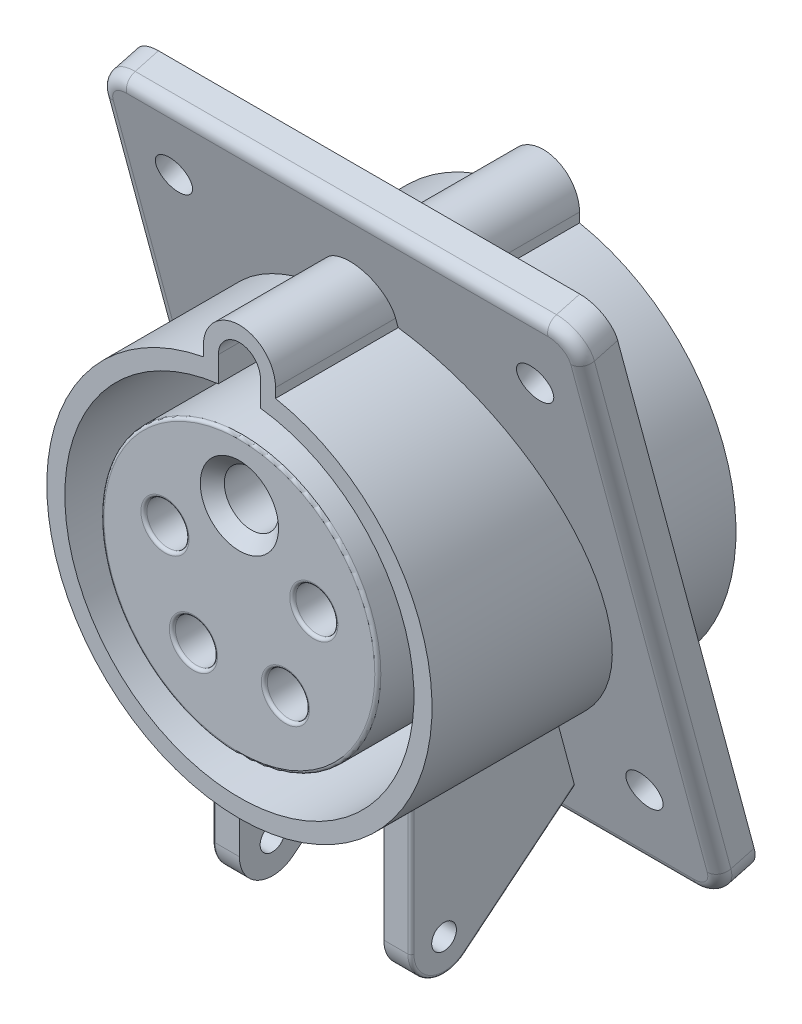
ISO-10303-21;
HEADER;
FILE_DESCRIPTION(('STEP AP214'),'2;1');
FILE_NAME('part.step','',(''),(''),'','','');
FILE_SCHEMA(('AUTOMOTIVE_DESIGN { 1 0 10303 214 1 1 1 1 }'));
ENDSEC;
DATA;
#1=APPLICATION_CONTEXT('core data for automotive mechanical design processes');
#2=APPLICATION_PROTOCOL_DEFINITION('international standard','automotive_design',2000,#1);
#3=PRODUCT_CONTEXT('',#1,'mechanical');
#4=PRODUCT('Part','Part','',(#3));
#5=PRODUCT_RELATED_PRODUCT_CATEGORY('part','',(#4));
#6=PRODUCT_DEFINITION_FORMATION('','',#4);
#7=PRODUCT_DEFINITION_CONTEXT('part definition',#1,'design');
#8=PRODUCT_DEFINITION('design','',#6,#7);
#9=PRODUCT_DEFINITION_SHAPE('','',#8);
#10=(LENGTH_UNIT() NAMED_UNIT(*) SI_UNIT(.MILLI.,.METRE.));
#11=(NAMED_UNIT(*) PLANE_ANGLE_UNIT() SI_UNIT($,.RADIAN.));
#12=(NAMED_UNIT(*) SI_UNIT($,.STERADIAN.) SOLID_ANGLE_UNIT());
#13=UNCERTAINTY_MEASURE_WITH_UNIT(LENGTH_MEASURE(1.E-05),#10,'distance_accuracy_value','');
#14=(GEOMETRIC_REPRESENTATION_CONTEXT(3) GLOBAL_UNCERTAINTY_ASSIGNED_CONTEXT((#13)) GLOBAL_UNIT_ASSIGNED_CONTEXT((#10,
#11,#12)) REPRESENTATION_CONTEXT('',''));
#15=CARTESIAN_POINT('',(0.,0.,0.));
#16=DIRECTION('',(0.,0.,1.));
#17=DIRECTION('',(1.,0.,0.));
#18=AXIS2_PLACEMENT_3D('',#15,#16,#17);
#19=CARTESIAN_POINT('',(0.,0.,52.));
#20=DIRECTION('',(0.,0.,1.));
#21=DIRECTION('',(1.,0.,0.));
#22=AXIS2_PLACEMENT_3D('',#19,#20,#21);
#23=PLANE('',#22);
#24=CARTESIAN_POINT('',(0.,13.,52.));
#25=DIRECTION('',(0.,0.,1.));
#26=DIRECTION('',(1.,0.,0.));
#27=AXIS2_PLACEMENT_3D('',#24,#25,#26);
#28=CIRCLE('',#27,6.50000000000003);
#29=CARTESIAN_POINT('',(6.50000000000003,13.,52.));
#30=VERTEX_POINT('',#29);
#31=EDGE_CURVE('E11',#30,#30,#28,.F.);
#32=ORIENTED_EDGE('',*,*,#31,.T.);
#33=EDGE_LOOP('',(#32));
#34=FACE_BOUND('',#33,.T.);
#35=CARTESIAN_POINT('',(12.3637347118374,4.01722092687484,52.));
#36=DIRECTION('',(0.,0.,1.));
#37=DIRECTION('',(1.,0.,0.));
#38=AXIS2_PLACEMENT_3D('',#35,#36,#37);
#39=CIRCLE('',#38,4.);
#40=CARTESIAN_POINT('',(16.3637347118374,4.01722092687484,52.));
#41=VERTEX_POINT('',#40);
#42=EDGE_CURVE('E70',#41,#41,#39,.F.);
#43=ORIENTED_EDGE('',*,*,#42,.T.);
#44=EDGE_LOOP('',(#43));
#45=FACE_BOUND('',#44,.T.);
#46=CARTESIAN_POINT('',(7.64120827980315,-10.517220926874,52.));
#47=DIRECTION('',(0.,0.,1.));
#48=DIRECTION('',(1.,0.,0.));
#49=AXIS2_PLACEMENT_3D('',#46,#47,#48);
#50=CIRCLE('',#49,4.);
#51=CARTESIAN_POINT('',(11.6412082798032,-10.517220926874,52.));
#52=VERTEX_POINT('',#51);
#53=EDGE_CURVE('E73',#52,#52,#50,.F.);
#54=ORIENTED_EDGE('',*,*,#53,.T.);
#55=EDGE_LOOP('',(#54));
#56=FACE_BOUND('',#55,.T.);
#57=CARTESIAN_POINT('',(-7.64120827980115,-10.5172209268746,52.));
#58=DIRECTION('',(0.,0.,1.));
#59=DIRECTION('',(1.,0.,0.));
#60=AXIS2_PLACEMENT_3D('',#57,#58,#59);
#61=CIRCLE('',#60,4.);
#62=CARTESIAN_POINT('',(-3.64120827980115,-10.5172209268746,52.));
#63=VERTEX_POINT('',#62);
#64=EDGE_CURVE('E76',#63,#63,#61,.F.);
#65=ORIENTED_EDGE('',*,*,#64,.T.);
#66=EDGE_LOOP('',(#65));
#67=FACE_BOUND('',#66,.T.);
#68=CARTESIAN_POINT('',(-12.3637347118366,4.01722092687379,52.));
#69=DIRECTION('',(0.,0.,1.));
#70=DIRECTION('',(1.,0.,0.));
#71=AXIS2_PLACEMENT_3D('',#68,#69,#70);
#72=CIRCLE('',#71,4.);
#73=CARTESIAN_POINT('',(-8.36373471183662,4.01722092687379,52.));
#74=VERTEX_POINT('',#73);
#75=EDGE_CURVE('E79',#74,#74,#72,.F.);
#76=ORIENTED_EDGE('',*,*,#75,.T.);
#77=EDGE_LOOP('',(#76));
#78=FACE_BOUND('',#77,.T.);
#79=CARTESIAN_POINT('',(0.,0.,52.));
#80=DIRECTION('',(0.,0.,1.));
#81=DIRECTION('',(1.,0.,0.));
#82=AXIS2_PLACEMENT_3D('',#79,#80,#81);
#83=CIRCLE('',#82,22.5);
#84=CARTESIAN_POINT('',(22.5,0.,52.));
#85=VERTEX_POINT('',#84);
#86=EDGE_CURVE('E85',#85,#85,#83,.T.);
#87=ORIENTED_EDGE('',*,*,#86,.T.);
#88=EDGE_LOOP('',(#87));
#89=FACE_BOUND('',#88,.T.);
#90=ADVANCED_FACE('F47',(#34,#45,#56,#67,#78,#89),#23,.T.);
#91=CARTESIAN_POINT('',(0.,0.,1.5));
#92=DIRECTION('',(0.,0.,-1.));
#93=DIRECTION('',(-1.,0.,0.));
#94=AXIS2_PLACEMENT_3D('',#91,#92,#93);
#95=PLANE('',#94);
#96=CARTESIAN_POINT('',(0.,0.,1.5));
#97=DIRECTION('',(0.,0.,-1.));
#98=DIRECTION('',(-1.,0.,0.));
#99=AXIS2_PLACEMENT_3D('',#96,#97,#98);
#100=CIRCLE('',#99,23.);
#101=CARTESIAN_POINT('',(-23.,0.,1.5));
#102=VERTEX_POINT('',#101);
#103=EDGE_CURVE('E91',#102,#102,#100,.T.);
#104=ORIENTED_EDGE('',*,*,#103,.T.);
#105=EDGE_LOOP('',(#104));
#106=FACE_BOUND('',#105,.T.);
#107=ADVANCED_FACE('F127',(#106),#95,.T.);
#108=CARTESIAN_POINT('',(0.,0.,117.053823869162));
#109=DIRECTION('',(0.,0.,-1.));
#110=DIRECTION('',(-1.,0.,0.));
#111=AXIS2_PLACEMENT_3D('',#108,#109,#110);
#112=CYLINDRICAL_SURFACE('',#111,23.);
#113=CARTESIAN_POINT('',(0.,0.,51.5));
#114=DIRECTION('',(0.,0.,1.));
#115=DIRECTION('',(1.,0.,0.));
#116=AXIS2_PLACEMENT_3D('',#113,#114,#115);
#117=CIRCLE('',#116,23.);
#118=CARTESIAN_POINT('',(23.,0.,51.5));
#119=VERTEX_POINT('',#118);
#120=EDGE_CURVE('E88',#119,#119,#117,.F.);
#121=ORIENTED_EDGE('',*,*,#120,.T.);
#122=EDGE_LOOP('',(#121));
#123=FACE_BOUND('',#122,.T.);
#124=ORIENTED_EDGE('',*,*,#103,.F.);
#125=EDGE_LOOP('',(#124));
#126=FACE_BOUND('',#125,.T.);
#127=ADVANCED_FACE('F132',(#123,#126),#112,.T.);
#128=CARTESIAN_POINT('',(0.,0.,51.5));
#129=DIRECTION('',(0.,0.,1.));
#130=DIRECTION('',(1.,0.,0.));
#131=AXIS2_PLACEMENT_3D('',#128,#129,#130);
#132=TOROIDAL_SURFACE('',#131,22.5,0.5);
#133=ORIENTED_EDGE('',*,*,#86,.F.);
#134=EDGE_LOOP('',(#133));
#135=FACE_BOUND('',#134,.T.);
#136=ORIENTED_EDGE('',*,*,#120,.F.);
#137=EDGE_LOOP('',(#136));
#138=FACE_BOUND('',#137,.T.);
#139=ADVANCED_FACE('F138',(#135,#138),#132,.T.);
#140=CARTESIAN_POINT('',(-12.3637347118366,4.01722092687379,5.99999999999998));
#141=DIRECTION('',(0.,0.,1.));
#142=DIRECTION('',(1.,0.,0.));
#143=AXIS2_PLACEMENT_3D('',#140,#141,#142);
#144=CYLINDRICAL_SURFACE('',#143,3.5);
#145=CARTESIAN_POINT('',(-12.3637347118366,4.01722092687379,51.5));
#146=DIRECTION('',(0.,0.,1.));
#147=DIRECTION('',(1.,0.,0.));
#148=AXIS2_PLACEMENT_3D('',#145,#146,#147);
#149=CIRCLE('',#148,3.5);
#150=CARTESIAN_POINT('',(-8.86373471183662,4.01722092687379,51.5));
#151=VERTEX_POINT('',#150);
#152=EDGE_CURVE('E58',#151,#151,#149,.T.);
#153=ORIENTED_EDGE('',*,*,#152,.T.);
#154=EDGE_LOOP('',(#153));
#155=FACE_BOUND('',#154,.T.);
#156=CARTESIAN_POINT('',(-12.3637347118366,4.01722092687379,5.99999999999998));
#157=DIRECTION('',(0.,0.,1.));
#158=DIRECTION('',(1.,0.,0.));
#159=AXIS2_PLACEMENT_3D('',#156,#157,#158);
#160=CIRCLE('',#159,3.5);
#161=CARTESIAN_POINT('',(-8.86373471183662,4.01722092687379,5.99999999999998));
#162=VERTEX_POINT('',#161);
#163=EDGE_CURVE('E95',#162,#162,#160,.T.);
#164=ORIENTED_EDGE('',*,*,#163,.F.);
#165=EDGE_LOOP('',(#164));
#166=FACE_BOUND('',#165,.T.);
#167=ADVANCED_FACE('F140',(#155,#166),#144,.F.);
#168=CARTESIAN_POINT('',(-12.3637347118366,4.01722092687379,5.99999999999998));
#169=DIRECTION('',(0.,0.,1.));
#170=DIRECTION('',(1.,0.,0.));
#171=AXIS2_PLACEMENT_3D('',#168,#169,#170);
#172=PLANE('',#171);
#173=ORIENTED_EDGE('',*,*,#163,.T.);
#174=EDGE_LOOP('',(#173));
#175=FACE_BOUND('',#174,.T.);
#176=ADVANCED_FACE('F162',(#175),#172,.T.);
#177=CARTESIAN_POINT('',(-7.64120827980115,-10.5172209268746,5.99999999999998));
#178=DIRECTION('',(0.,0.,1.));
#179=DIRECTION('',(1.,0.,0.));
#180=AXIS2_PLACEMENT_3D('',#177,#178,#179);
#181=CYLINDRICAL_SURFACE('',#180,3.5);
#182=CARTESIAN_POINT('',(-7.64120827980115,-10.5172209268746,51.5));
#183=DIRECTION('',(0.,0.,1.));
#184=DIRECTION('',(1.,0.,0.));
#185=AXIS2_PLACEMENT_3D('',#182,#183,#184);
#186=CIRCLE('',#185,3.5);
#187=CARTESIAN_POINT('',(-4.14120827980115,-10.5172209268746,51.5));
#188=VERTEX_POINT('',#187);
#189=EDGE_CURVE('E62',#188,#188,#186,.T.);
#190=ORIENTED_EDGE('',*,*,#189,.T.);
#191=EDGE_LOOP('',(#190));
#192=FACE_BOUND('',#191,.T.);
#193=CARTESIAN_POINT('',(-7.64120827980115,-10.5172209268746,5.99999999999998));
#194=DIRECTION('',(0.,0.,1.));
#195=DIRECTION('',(1.,0.,0.));
#196=AXIS2_PLACEMENT_3D('',#193,#194,#195);
#197=CIRCLE('',#196,3.5);
#198=CARTESIAN_POINT('',(-4.14120827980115,-10.5172209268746,5.99999999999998));
#199=VERTEX_POINT('',#198);
#200=EDGE_CURVE('E98',#199,#199,#197,.T.);
#201=ORIENTED_EDGE('',*,*,#200,.F.);
#202=EDGE_LOOP('',(#201));
#203=FACE_BOUND('',#202,.T.);
#204=ADVANCED_FACE('F167',(#192,#203),#181,.F.);
#205=CARTESIAN_POINT('',(-7.64120827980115,-10.5172209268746,5.99999999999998));
#206=DIRECTION('',(0.,0.,1.));
#207=DIRECTION('',(1.,0.,0.));
#208=AXIS2_PLACEMENT_3D('',#205,#206,#207);
#209=PLANE('',#208);
#210=ORIENTED_EDGE('',*,*,#200,.T.);
#211=EDGE_LOOP('',(#210));
#212=FACE_BOUND('',#211,.T.);
#213=ADVANCED_FACE('F172',(#212),#209,.T.);
#214=CARTESIAN_POINT('',(7.64120827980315,-10.517220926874,5.99999999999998));
#215=DIRECTION('',(0.,0.,1.));
#216=DIRECTION('',(1.,0.,0.));
#217=AXIS2_PLACEMENT_3D('',#214,#215,#216);
#218=CYLINDRICAL_SURFACE('',#217,3.5);
#219=CARTESIAN_POINT('',(7.64120827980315,-10.517220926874,51.5));
#220=DIRECTION('',(0.,0.,1.));
#221=DIRECTION('',(1.,0.,0.));
#222=AXIS2_PLACEMENT_3D('',#219,#220,#221);
#223=CIRCLE('',#222,3.5);
#224=CARTESIAN_POINT('',(11.1412082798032,-10.517220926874,51.5));
#225=VERTEX_POINT('',#224);
#226=EDGE_CURVE('E67',#225,#225,#223,.T.);
#227=ORIENTED_EDGE('',*,*,#226,.T.);
#228=EDGE_LOOP('',(#227));
#229=FACE_BOUND('',#228,.T.);
#230=CARTESIAN_POINT('',(7.64120827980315,-10.517220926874,5.99999999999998));
#231=DIRECTION('',(0.,0.,1.));
#232=DIRECTION('',(1.,0.,0.));
#233=AXIS2_PLACEMENT_3D('',#230,#231,#232);
#234=CIRCLE('',#233,3.5);
#235=CARTESIAN_POINT('',(11.1412082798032,-10.517220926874,5.99999999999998));
#236=VERTEX_POINT('',#235);
#237=EDGE_CURVE('E102',#236,#236,#234,.T.);
#238=ORIENTED_EDGE('',*,*,#237,.F.);
#239=EDGE_LOOP('',(#238));
#240=FACE_BOUND('',#239,.T.);
#241=ADVANCED_FACE('F178',(#229,#240),#218,.F.);
#242=CARTESIAN_POINT('',(7.64120827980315,-10.517220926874,5.99999999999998));
#243=DIRECTION('',(0.,0.,1.));
#244=DIRECTION('',(1.,0.,0.));
#245=AXIS2_PLACEMENT_3D('',#242,#243,#244);
#246=PLANE('',#245);
#247=ORIENTED_EDGE('',*,*,#237,.T.);
#248=EDGE_LOOP('',(#247));
#249=FACE_BOUND('',#248,.T.);
#250=ADVANCED_FACE('F182',(#249),#246,.T.);
#251=CARTESIAN_POINT('',(12.3637347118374,4.01722092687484,5.99999999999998));
#252=DIRECTION('',(0.,0.,1.));
#253=DIRECTION('',(1.,0.,0.));
#254=AXIS2_PLACEMENT_3D('',#251,#252,#253);
#255=CYLINDRICAL_SURFACE('',#254,3.5);
#256=CARTESIAN_POINT('',(12.3637347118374,4.01722092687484,51.5));
#257=DIRECTION('',(0.,0.,1.));
#258=DIRECTION('',(1.,0.,0.));
#259=AXIS2_PLACEMENT_3D('',#256,#257,#258);
#260=CIRCLE('',#259,3.5);
#261=CARTESIAN_POINT('',(15.8637347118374,4.01722092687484,51.5));
#262=VERTEX_POINT('',#261);
#263=EDGE_CURVE('E82',#262,#262,#260,.T.);
#264=ORIENTED_EDGE('',*,*,#263,.T.);
#265=EDGE_LOOP('',(#264));
#266=FACE_BOUND('',#265,.T.);
#267=CARTESIAN_POINT('',(12.3637347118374,4.01722092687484,5.99999999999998));
#268=DIRECTION('',(0.,0.,1.));
#269=DIRECTION('',(1.,0.,0.));
#270=AXIS2_PLACEMENT_3D('',#267,#268,#269);
#271=CIRCLE('',#270,3.5);
#272=CARTESIAN_POINT('',(15.8637347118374,4.01722092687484,5.99999999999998));
#273=VERTEX_POINT('',#272);
#274=EDGE_CURVE('E94',#273,#273,#271,.T.);
#275=ORIENTED_EDGE('',*,*,#274,.F.);
#276=EDGE_LOOP('',(#275));
#277=FACE_BOUND('',#276,.T.);
#278=ADVANCED_FACE('F186',(#266,#277),#255,.F.);
#279=CARTESIAN_POINT('',(12.3637347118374,4.01722092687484,5.99999999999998));
#280=DIRECTION('',(0.,0.,1.));
#281=DIRECTION('',(1.,0.,0.));
#282=AXIS2_PLACEMENT_3D('',#279,#280,#281);
#283=PLANE('',#282);
#284=ORIENTED_EDGE('',*,*,#274,.T.);
#285=EDGE_LOOP('',(#284));
#286=FACE_BOUND('',#285,.T.);
#287=ADVANCED_FACE('F123',(#286),#283,.T.);
#288=CARTESIAN_POINT('',(0.,13.,-6.72792206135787));
#289=DIRECTION('',(0.,0.,1.));
#290=DIRECTION('',(1.,0.,0.));
#291=AXIS2_PLACEMENT_3D('',#288,#289,#290);
#292=CYLINDRICAL_SURFACE('',#291,4.5);
#293=CARTESIAN_POINT('',(0.,13.,50.));
#294=DIRECTION('',(0.,0.,1.));
#295=DIRECTION('',(1.,0.,0.));
#296=AXIS2_PLACEMENT_3D('',#293,#294,#295);
#297=CIRCLE('',#296,4.5);
#298=CARTESIAN_POINT('',(4.5,13.,50.));
#299=VERTEX_POINT('',#298);
#300=EDGE_CURVE('E54',#299,#299,#297,.T.);
#301=ORIENTED_EDGE('',*,*,#300,.T.);
#302=EDGE_LOOP('',(#301));
#303=FACE_BOUND('',#302,.T.);
#304=CARTESIAN_POINT('',(0.,13.,5.99999999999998));
#305=DIRECTION('',(0.,0.,1.));
#306=DIRECTION('',(1.,0.,0.));
#307=AXIS2_PLACEMENT_3D('',#304,#305,#306);
#308=CIRCLE('',#307,4.5);
#309=CARTESIAN_POINT('',(4.5,13.,5.99999999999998));
#310=VERTEX_POINT('',#309);
#311=EDGE_CURVE('E99',#310,#310,#308,.F.);
#312=ORIENTED_EDGE('',*,*,#311,.T.);
#313=EDGE_LOOP('',(#312));
#314=FACE_BOUND('',#313,.T.);
#315=ADVANCED_FACE('F110',(#303,#314),#292,.F.);
#316=CARTESIAN_POINT('',(0.,13.,5.99999999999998));
#317=DIRECTION('',(0.,0.,1.));
#318=DIRECTION('',(1.,0.,0.));
#319=AXIS2_PLACEMENT_3D('',#316,#317,#318);
#320=PLANE('',#319);
#321=ORIENTED_EDGE('',*,*,#311,.F.);
#322=EDGE_LOOP('',(#321));
#323=FACE_BOUND('',#322,.T.);
#324=ADVANCED_FACE('F112',(#323),#320,.T.);
#325=CARTESIAN_POINT('',(12.3637347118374,4.01722092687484,51.5));
#326=DIRECTION('',(0.,0.,1.));
#327=DIRECTION('',(1.,0.,0.));
#328=AXIS2_PLACEMENT_3D('',#325,#326,#327);
#329=TOROIDAL_SURFACE('',#328,4.,0.5);
#330=ORIENTED_EDGE('',*,*,#42,.F.);
#331=EDGE_LOOP('',(#330));
#332=FACE_BOUND('',#331,.T.);
#333=ORIENTED_EDGE('',*,*,#263,.F.);
#334=EDGE_LOOP('',(#333));
#335=FACE_BOUND('',#334,.T.);
#336=ADVANCED_FACE('F114',(#332,#335),#329,.T.);
#337=CARTESIAN_POINT('',(7.64120827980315,-10.517220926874,51.5));
#338=DIRECTION('',(0.,0.,1.));
#339=DIRECTION('',(1.,0.,0.));
#340=AXIS2_PLACEMENT_3D('',#337,#338,#339);
#341=TOROIDAL_SURFACE('',#340,4.,0.5);
#342=ORIENTED_EDGE('',*,*,#53,.F.);
#343=EDGE_LOOP('',(#342));
#344=FACE_BOUND('',#343,.T.);
#345=ORIENTED_EDGE('',*,*,#226,.F.);
#346=EDGE_LOOP('',(#345));
#347=FACE_BOUND('',#346,.T.);
#348=ADVANCED_FACE('F120',(#344,#347),#341,.T.);
#349=CARTESIAN_POINT('',(-7.64120827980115,-10.5172209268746,51.5));
#350=DIRECTION('',(0.,0.,1.));
#351=DIRECTION('',(1.,0.,0.));
#352=AXIS2_PLACEMENT_3D('',#349,#350,#351);
#353=TOROIDAL_SURFACE('',#352,4.,0.5);
#354=ORIENTED_EDGE('',*,*,#64,.F.);
#355=EDGE_LOOP('',(#354));
#356=FACE_BOUND('',#355,.T.);
#357=ORIENTED_EDGE('',*,*,#189,.F.);
#358=EDGE_LOOP('',(#357));
#359=FACE_BOUND('',#358,.T.);
#360=ADVANCED_FACE('F145',(#356,#359),#353,.T.);
#361=CARTESIAN_POINT('',(-12.3637347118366,4.01722092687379,51.5));
#362=DIRECTION('',(0.,0.,1.));
#363=DIRECTION('',(1.,0.,0.));
#364=AXIS2_PLACEMENT_3D('',#361,#362,#363);
#365=TOROIDAL_SURFACE('',#364,4.,0.5);
#366=ORIENTED_EDGE('',*,*,#75,.F.);
#367=EDGE_LOOP('',(#366));
#368=FACE_BOUND('',#367,.T.);
#369=ORIENTED_EDGE('',*,*,#152,.F.);
#370=EDGE_LOOP('',(#369));
#371=FACE_BOUND('',#370,.T.);
#372=ADVANCED_FACE('F148',(#368,#371),#365,.T.);
#373=CARTESIAN_POINT('',(0.,13.,50.));
#374=DIRECTION('',(0.,0.,1.));
#375=DIRECTION('',(1.,0.,0.));
#376=AXIS2_PLACEMENT_3D('',#373,#374,#375);
#377=CONICAL_SURFACE('',#376,4.5,0.785398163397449);
#378=ORIENTED_EDGE('',*,*,#31,.F.);
#379=EDGE_LOOP('',(#378));
#380=FACE_BOUND('',#379,.T.);
#381=ORIENTED_EDGE('',*,*,#300,.F.);
#382=EDGE_LOOP('',(#381));
#383=FACE_BOUND('',#382,.T.);
#384=ADVANCED_FACE('F49',(#380,#383),#377,.F.);
#385=CLOSED_SHELL('',(#90,#107,#127,#139,#167,#176,#204,#213,#241,#250,#278,#287,#315,#324,#336,
#348,#360,#372,#384));
#386=MANIFOLD_SOLID_BREP('B2',#385);
#387=CARTESIAN_POINT('',(-16.5,-49.5,40.0000321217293));
#388=DIRECTION('',(0.,0.,1.));
#389=DIRECTION('',(1.,0.,0.));
#390=AXIS2_PLACEMENT_3D('',#387,#388,#389);
#391=PLANE('',#390);
#392=CARTESIAN_POINT('',(0.,0.,40.0000321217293));
#393=DIRECTION('',(0.,0.,1.));
#394=DIRECTION('',(1.,0.,0.));
#395=AXIS2_PLACEMENT_3D('',#392,#393,#394);
#396=CIRCLE('',#395,32.);
#397=CARTESIAN_POINT('',(-16.,-27.712812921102,40.0000321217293));
#398=VERTEX_POINT('',#397);
#399=CARTESIAN_POINT('',(-12.,-29.6647939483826,40.0000321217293));
#400=VERTEX_POINT('',#399);
#401=EDGE_CURVE('E663',#398,#400,#396,.T.);
#402=ORIENTED_EDGE('',*,*,#401,.F.);
#403=DIRECTION('',(0.,-1.,0.));
#404=VECTOR('',#403,1.);
#405=CARTESIAN_POINT('',(-16.,-49.5,40.0000321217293));
#406=LINE('',#405,#404);
#407=CARTESIAN_POINT('',(-16.,-49.5,40.0000321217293));
#408=VERTEX_POINT('',#407);
#409=EDGE_CURVE('E921',#398,#408,#406,.T.);
#410=ORIENTED_EDGE('',*,*,#409,.T.);
#411=DIRECTION('',(1.,0.,0.));
#412=VECTOR('',#411,1.);
#413=CARTESIAN_POINT('',(-16.5,-49.5,40.0000321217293));
#414=LINE('',#413,#412);
#415=CARTESIAN_POINT('',(-12.,-49.5,40.0000321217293));
#416=VERTEX_POINT('',#415);
#417=EDGE_CURVE('E654',#408,#416,#414,.T.);
#418=ORIENTED_EDGE('',*,*,#417,.T.);
#419=DIRECTION('',(0.,-1.,0.));
#420=VECTOR('',#419,1.);
#421=CARTESIAN_POINT('',(-12.,-60.3890192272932,40.0000321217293));
#422=LINE('',#421,#420);
#423=EDGE_CURVE('E625',#400,#416,#422,.T.);
#424=ORIENTED_EDGE('',*,*,#423,.F.);
#425=EDGE_LOOP('',(#402,#410,#418,#424));
#426=FACE_BOUND('',#425,.T.);
#427=ADVANCED_FACE('F351',(#426),#391,.T.);
#428=CARTESIAN_POINT('',(-16.5,-49.5,34.5));
#429=DIRECTION('',(1.,0.,0.));
#430=DIRECTION('',(0.,0.,-1.));
#431=AXIS2_PLACEMENT_3D('',#428,#429,#430);
#432=CYLINDRICAL_SURFACE('',#431,5.5000321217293);
#433=ORIENTED_EDGE('',*,*,#417,.F.);
#434=CARTESIAN_POINT('',(-16.,-49.5,34.5));
#435=DIRECTION('',(1.,0.,0.));
#436=DIRECTION('',(0.,0.,-1.));
#437=AXIS2_PLACEMENT_3D('',#434,#435,#436);
#438=CIRCLE('',#437,5.5000321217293);
#439=CARTESIAN_POINT('',(-16.,-53.763749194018,31.0256948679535));
#440=VERTEX_POINT('',#439);
#441=EDGE_CURVE('E910',#408,#440,#438,.T.);
#442=ORIENTED_EDGE('',*,*,#441,.T.);
#443=DIRECTION('',(1.,0.,0.));
#444=VECTOR('',#443,1.);
#445=CARTESIAN_POINT('',(-16.5,-53.763749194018,31.0256948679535));
#446=LINE('',#445,#444);
#447=CARTESIAN_POINT('',(-12.,-53.763749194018,31.0256948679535));
#448=VERTEX_POINT('',#447);
#449=EDGE_CURVE('E661',#440,#448,#446,.T.);
#450=ORIENTED_EDGE('',*,*,#449,.T.);
#451=CARTESIAN_POINT('',(-12.,-49.5,34.5));
#452=DIRECTION('',(-1.,0.,0.));
#453=DIRECTION('',(0.,0.,1.));
#454=AXIS2_PLACEMENT_3D('',#451,#452,#453);
#455=CIRCLE('',#454,5.5000321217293);
#456=EDGE_CURVE('E640',#416,#448,#455,.F.);
#457=ORIENTED_EDGE('',*,*,#456,.F.);
#458=EDGE_LOOP('',(#433,#442,#450,#457));
#459=FACE_BOUND('',#458,.T.);
#460=ADVANCED_FACE('F961',(#459),#432,.T.);
#461=CARTESIAN_POINT('',(-16.5,-49.5,34.5));
#462=DIRECTION('',(1.,0.,0.));
#463=DIRECTION('',(0.,0.,-1.));
#464=AXIS2_PLACEMENT_3D('',#461,#462,#463);
#465=CYLINDRICAL_SURFACE('',#464,2.05474005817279);
#466=CARTESIAN_POINT('',(-12.,-49.5,34.5));
#467=DIRECTION('',(-1.,0.,0.));
#468=DIRECTION('',(0.,0.,1.));
#469=AXIS2_PLACEMENT_3D('',#466,#467,#468);
#470=CIRCLE('',#469,2.05474005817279);
#471=CARTESIAN_POINT('',(-12.,-49.5,36.5547400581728));
#472=VERTEX_POINT('',#471);
#473=EDGE_CURVE('E636',#472,#472,#470,.F.);
#474=ORIENTED_EDGE('',*,*,#473,.T.);
#475=EDGE_LOOP('',(#474));
#476=FACE_BOUND('',#475,.T.);
#477=CARTESIAN_POINT('',(-16.5,-49.5,34.5));
#478=DIRECTION('',(1.,0.,0.));
#479=DIRECTION('',(0.,0.,-1.));
#480=AXIS2_PLACEMENT_3D('',#477,#478,#479);
#481=CIRCLE('',#480,2.05474005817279);
#482=CARTESIAN_POINT('',(-16.5,-49.5,32.4452599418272));
#483=VERTEX_POINT('',#482);
#484=EDGE_CURVE('E648',#483,#483,#481,.T.);
#485=ORIENTED_EDGE('',*,*,#484,.F.);
#486=EDGE_LOOP('',(#485));
#487=FACE_BOUND('',#486,.T.);
#488=ADVANCED_FACE('F968',(#476,#487),#465,.F.);
#489=CARTESIAN_POINT('',(-40.,48.6282917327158,36.2467455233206));
#490=DIRECTION('',(0.,-0.259410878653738,0.96576705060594));
#491=DIRECTION('',(0.,-0.96576705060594,-0.259410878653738));
#492=AXIS2_PLACEMENT_3D('',#489,#490,#491);
#493=PLANE('',#492);
#494=CARTESIAN_POINT('',(30.,-31.5450880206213,14.7116901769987));
#495=DIRECTION('',(0.,-0.259410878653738,0.96576705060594));
#496=DIRECTION('',(0.,-0.96576705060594,-0.259410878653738));
#497=AXIS2_PLACEMENT_3D('',#494,#495,#496);
#498=CIRCLE('',#497,2.99999999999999);
#499=CARTESIAN_POINT('',(30.,-34.4423891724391,13.9334575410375));
#500=VERTEX_POINT('',#499);
#501=EDGE_CURVE('E665',#500,#500,#498,.T.);
#502=ORIENTED_EDGE('',*,*,#501,.F.);
#503=EDGE_LOOP('',(#502));
#504=FACE_BOUND('',#503,.T.);
#505=CARTESIAN_POINT('',(-30.,-31.5450880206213,14.7116901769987));
#506=DIRECTION('',(0.,-0.259410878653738,0.96576705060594));
#507=DIRECTION('',(0.,-0.96576705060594,-0.259410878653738));
#508=AXIS2_PLACEMENT_3D('',#505,#506,#507);
#509=CIRCLE('',#508,2.99999999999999);
#510=CARTESIAN_POINT('',(-30.,-34.4423891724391,13.9334575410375));
#511=VERTEX_POINT('',#510);
#512=EDGE_CURVE('E670',#511,#511,#509,.T.);
#513=ORIENTED_EDGE('',*,*,#512,.F.);
#514=EDGE_LOOP('',(#513));
#515=FACE_BOUND('',#514,.T.);
#516=CARTESIAN_POINT('',(-30.,36.0586055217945,32.8704516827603));
#517=DIRECTION('',(0.,-0.259410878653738,0.96576705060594));
#518=DIRECTION('',(0.,-0.96576705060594,-0.259410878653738));
#519=AXIS2_PLACEMENT_3D('',#516,#517,#518);
#520=CIRCLE('',#519,3.);
#521=CARTESIAN_POINT('',(-30.,33.1613043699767,32.0922190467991));
#522=VERTEX_POINT('',#521);
#523=EDGE_CURVE('E666',#522,#522,#520,.T.);
#524=ORIENTED_EDGE('',*,*,#523,.F.);
#525=EDGE_LOOP('',(#524));
#526=FACE_BOUND('',#525,.T.);
#527=CARTESIAN_POINT('',(30.,36.0586055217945,32.8704516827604));
#528=DIRECTION('',(0.,-0.259410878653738,0.96576705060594));
#529=DIRECTION('',(0.,-0.96576705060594,-0.259410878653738));
#530=AXIS2_PLACEMENT_3D('',#527,#528,#529);
#531=CIRCLE('',#530,2.99999999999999);
#532=CARTESIAN_POINT('',(30.,33.1613043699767,32.0922190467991));
#533=VERTEX_POINT('',#532);
#534=EDGE_CURVE('E669',#533,#533,#531,.T.);
#535=ORIENTED_EDGE('',*,*,#534,.F.);
#536=EDGE_LOOP('',(#535));
#537=FACE_BOUND('',#536,.T.);
#538=DIRECTION('',(1.,0.,0.));
#539=VECTOR('',#538,1.);
#540=CARTESIAN_POINT('',(-40.,46.6967576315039,35.7279237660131));
#541=LINE('',#540,#539);
#542=CARTESIAN_POINT('',(35.,46.6967576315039,35.7279237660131));
#543=VERTEX_POINT('',#542);
#544=CARTESIAN_POINT('',(-35.,46.6967576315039,35.7279237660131));
#545=VERTEX_POINT('',#544);
#546=EDGE_CURVE('E846',#543,#545,#541,.F.);
#547=ORIENTED_EDGE('',*,*,#546,.T.);
#548=CARTESIAN_POINT('',(-35.,43.7994564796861,34.9496911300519));
#549=DIRECTION('',(0.,-0.259410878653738,0.96576705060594));
#550=DIRECTION('',(0.,-0.96576705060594,-0.259410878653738));
#551=AXIS2_PLACEMENT_3D('',#548,#549,#550);
#552=CIRCLE('',#551,3.);
#553=CARTESIAN_POINT('',(-38.,43.7994564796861,34.9496911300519));
#554=VERTEX_POINT('',#553);
#555=EDGE_CURVE('E848',#545,#554,#552,.T.);
#556=ORIENTED_EDGE('',*,*,#555,.T.);
#557=DIRECTION('',(0.,-0.96576705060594,-0.259410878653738));
#558=VECTOR('',#557,1.);
#559=CARTESIAN_POINT('',(-38.,-40.5874614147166,12.2828539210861));
#560=LINE('',#559,#558);
#561=CARTESIAN_POINT('',(-38.,-40.5874614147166,12.2828539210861));
#562=VERTEX_POINT('',#561);
#563=EDGE_CURVE('E834',#554,#562,#560,.T.);
#564=ORIENTED_EDGE('',*,*,#563,.T.);
#565=CARTESIAN_POINT('',(-35.,-40.5874614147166,12.2828539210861));
#566=DIRECTION('',(0.,-0.259410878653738,0.96576705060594));
#567=DIRECTION('',(0.,-0.96576705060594,-0.259410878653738));
#568=AXIS2_PLACEMENT_3D('',#565,#566,#567);
#569=CIRCLE('',#568,3.);
#570=CARTESIAN_POINT('',(-35.,-43.4847625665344,11.5046212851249));
#571=VERTEX_POINT('',#570);
#572=EDGE_CURVE('E836',#562,#571,#569,.T.);
#573=ORIENTED_EDGE('',*,*,#572,.T.);
#574=DIRECTION('',(1.,0.,0.));
#575=VECTOR('',#574,1.);
#576=CARTESIAN_POINT('',(-40.,-43.4847625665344,11.5046212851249));
#577=LINE('',#576,#575);
#578=CARTESIAN_POINT('',(35.,-43.4847625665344,11.5046212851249));
#579=VERTEX_POINT('',#578);
#580=EDGE_CURVE('E838',#571,#579,#577,.T.);
#581=ORIENTED_EDGE('',*,*,#580,.T.);
#582=CARTESIAN_POINT('',(35.,-40.5874614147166,12.2828539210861));
#583=DIRECTION('',(0.,-0.259410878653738,0.96576705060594));
#584=DIRECTION('',(0.,-0.96576705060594,-0.259410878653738));
#585=AXIS2_PLACEMENT_3D('',#582,#583,#584);
#586=CIRCLE('',#585,3.);
#587=CARTESIAN_POINT('',(38.,-40.5874614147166,12.2828539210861));
#588=VERTEX_POINT('',#587);
#589=EDGE_CURVE('E840',#579,#588,#586,.T.);
#590=ORIENTED_EDGE('',*,*,#589,.T.);
#591=DIRECTION('',(0.,-0.96576705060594,-0.259410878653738));
#592=VECTOR('',#591,1.);
#593=CARTESIAN_POINT('',(38.,48.6282917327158,36.2467455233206));
#594=LINE('',#593,#592);
#595=CARTESIAN_POINT('',(38.,43.7994564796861,34.9496911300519));
#596=VERTEX_POINT('',#595);
#597=EDGE_CURVE('E842',#588,#596,#594,.F.);
#598=ORIENTED_EDGE('',*,*,#597,.T.);
#599=CARTESIAN_POINT('',(35.,43.7994564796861,34.9496911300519));
#600=DIRECTION('',(0.,-0.259410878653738,0.96576705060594));
#601=DIRECTION('',(0.,-0.96576705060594,-0.259410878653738));
#602=AXIS2_PLACEMENT_3D('',#599,#600,#601);
#603=CIRCLE('',#602,3.);
#604=EDGE_CURVE('E844',#596,#543,#603,.T.);
#605=ORIENTED_EDGE('',*,*,#604,.T.);
#606=EDGE_LOOP('',(#547,#556,#564,#573,#581,#590,#598,#605));
#607=FACE_BOUND('',#606,.T.);
#608=DIRECTION('',(1.,0.,0.));
#609=VECTOR('',#608,1.);
#610=CARTESIAN_POINT('',(-16.5,-38.8676199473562,12.744813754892));
#611=LINE('',#610,#609);
#612=CARTESIAN_POINT('',(-16.,-38.8676199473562,12.744813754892));
#613=VERTEX_POINT('',#612);
#614=CARTESIAN_POINT('',(16.,-38.8676199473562,12.744813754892));
#615=VERTEX_POINT('',#614);
#616=EDGE_CURVE('E658',#613,#615,#611,.T.);
#617=ORIENTED_EDGE('',*,*,#616,.F.);
#618=CARTESIAN_POINT('',(-16.,-38.3384622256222,12.8869487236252));
#619=DIRECTION('',(0.,-0.259410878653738,0.96576705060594));
#620=DIRECTION('',(0.,-0.96576705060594,-0.259410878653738));
#621=AXIS2_PLACEMENT_3D('',#618,#619,#620);
#622=ELLIPSE('',#621,0.547914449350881,0.5);
#623=CARTESIAN_POINT('',(-16.5,-38.3384622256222,12.8869487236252));
#624=VERTEX_POINT('',#623);
#625=EDGE_CURVE('E924',#613,#624,#622,.F.);
#626=ORIENTED_EDGE('',*,*,#625,.T.);
#627=DIRECTION('',(0.,0.96576705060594,0.259410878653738));
#628=VECTOR('',#627,1.);
#629=CARTESIAN_POINT('',(-16.5,-25.2432851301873,16.4043925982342));
#630=LINE('',#629,#628);
#631=CARTESIAN_POINT('',(-16.5,-27.4180597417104,15.8202349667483));
#632=VERTEX_POINT('',#631);
#633=EDGE_CURVE('E651',#624,#632,#630,.T.);
#634=ORIENTED_EDGE('',*,*,#633,.T.);
#635=CARTESIAN_POINT('',(0.,0.,23.1848918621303));
#636=DIRECTION('',(0.,-0.259410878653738,0.96576705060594));
#637=DIRECTION('',(0.,-0.96576705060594,-0.259410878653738));
#638=AXIS2_PLACEMENT_3D('',#635,#636,#637);
#639=ELLIPSE('',#638,33.1342842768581,32.);
#640=CARTESIAN_POINT('',(-6.,31.4324672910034,31.627842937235));
#641=VERTEX_POINT('',#640);
#642=EDGE_CURVE('E713',#641,#632,#639,.T.);
#643=ORIENTED_EDGE('',*,*,#642,.F.);
#644=DIRECTION('',(0.,0.96576705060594,0.259410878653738));
#645=VECTOR('',#644,1.);
#646=CARTESIAN_POINT('',(-6.,21.6680081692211,29.0050500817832));
#647=LINE('',#646,#645);
#648=CARTESIAN_POINT('',(-6.,33.,32.0488917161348));
#649=VERTEX_POINT('',#648);
#650=EDGE_CURVE('E709',#641,#649,#647,.T.);
#651=ORIENTED_EDGE('',*,*,#650,.T.);
#652=CARTESIAN_POINT('',(0.,33.,32.0488917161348));
#653=DIRECTION('',(0.,-0.259410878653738,0.96576705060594));
#654=DIRECTION('',(0.,0.96576705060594,0.259410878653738));
#655=AXIS2_PLACEMENT_3D('',#652,#653,#654);
#656=ELLIPSE('',#655,6.21267830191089,6.);
#657=CARTESIAN_POINT('',(6.,33.,32.0488917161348));
#658=VERTEX_POINT('',#657);
#659=EDGE_CURVE('E701',#649,#658,#656,.F.);
#660=ORIENTED_EDGE('',*,*,#659,.T.);
#661=DIRECTION('',(0.,-0.96576705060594,-0.259410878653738));
#662=VECTOR('',#661,1.);
#663=CARTESIAN_POINT('',(6.,19.3723530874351,28.3884232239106));
#664=LINE('',#663,#662);
#665=CARTESIAN_POINT('',(6.,31.4324672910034,31.627842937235));
#666=VERTEX_POINT('',#665);
#667=EDGE_CURVE('E706',#658,#666,#664,.T.);
#668=ORIENTED_EDGE('',*,*,#667,.T.);
#669=CARTESIAN_POINT('',(16.5,-27.4180597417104,15.8202349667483));
#670=VERTEX_POINT('',#669);
#671=EDGE_CURVE('E712',#670,#666,#639,.T.);
#672=ORIENTED_EDGE('',*,*,#671,.F.);
#673=DIRECTION('',(0.,0.96576705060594,0.259410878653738));
#674=VECTOR('',#673,1.);
#675=CARTESIAN_POINT('',(16.5,-25.2432851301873,16.4043925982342));
#676=LINE('',#675,#674);
#677=CARTESIAN_POINT('',(16.5,-38.3384622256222,12.8869487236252));
#678=VERTEX_POINT('',#677);
#679=EDGE_CURVE('E646',#678,#670,#676,.T.);
#680=ORIENTED_EDGE('',*,*,#679,.F.);
#681=CARTESIAN_POINT('',(16.,-38.3384622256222,12.8869487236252));
#682=DIRECTION('',(0.,-0.259410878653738,0.96576705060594));
#683=DIRECTION('',(0.,0.96576705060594,0.259410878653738));
#684=AXIS2_PLACEMENT_3D('',#681,#682,#683);
#685=ELLIPSE('',#684,0.547914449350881,0.5);
#686=EDGE_CURVE('E926',#678,#615,#685,.F.);
#687=ORIENTED_EDGE('',*,*,#686,.T.);
#688=EDGE_LOOP('',(#617,#626,#634,#643,#651,#660,#668,#672,#680,#687));
#689=FACE_BOUND('',#688,.T.);
#690=ADVANCED_FACE('F1014',(#504,#515,#526,#537,#607,#689),#493,.T.);
#691=CARTESIAN_POINT('',(0.,0.,52.));
#692=DIRECTION('',(0.,0.,-1.));
#693=DIRECTION('',(-1.,0.,0.));
#694=AXIS2_PLACEMENT_3D('',#691,#692,#693);
#695=CYLINDRICAL_SURFACE('',#694,32.);
#696=DIRECTION('',(0.,0.,-1.));
#697=VECTOR('',#696,1.);
#698=CARTESIAN_POINT('',(-16.5,-27.4180597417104,52.));
#699=LINE('',#698,#697);
#700=CARTESIAN_POINT('',(-16.5,-27.4180597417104,39.5000321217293));
#701=VERTEX_POINT('',#700);
#702=EDGE_CURVE('E891',#701,#632,#699,.T.);
#703=ORIENTED_EDGE('',*,*,#702,.F.);
#704=CARTESIAN_POINT('',(-16.5,-27.4180597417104,39.5000321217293));
#705=CARTESIAN_POINT('',(-16.5000335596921,-27.4180385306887,39.525325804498));
#706=CARTESIAN_POINT('',(-16.4980831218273,-27.4192133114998,39.5505884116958));
#707=CARTESIAN_POINT('',(-16.4904881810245,-27.4237822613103,39.6002301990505));
#708=CARTESIAN_POINT('',(-16.4848608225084,-27.427166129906,39.6246129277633));
#709=CARTESIAN_POINT('',(-16.4701887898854,-27.4359791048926,39.671897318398));
#710=CARTESIAN_POINT('',(-16.4611475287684,-27.4414061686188,39.6948004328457));
#711=CARTESIAN_POINT('',(-16.440057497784,-27.4540463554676,39.7386568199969));
#712=CARTESIAN_POINT('',(-16.4280059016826,-27.4612611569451,39.7596082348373));
#713=CARTESIAN_POINT('',(-16.4006053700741,-27.4776347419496,39.8002820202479));
#714=CARTESIAN_POINT('',(-16.3851099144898,-27.486879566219,39.8198704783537));
#715=CARTESIAN_POINT('',(-16.3518053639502,-27.5067053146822,39.856178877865));
#716=CARTESIAN_POINT('',(-16.3339957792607,-27.5172865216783,39.8728982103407));
#717=CARTESIAN_POINT('',(-16.2939952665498,-27.5409935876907,39.9053934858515));
#718=CARTESIAN_POINT('',(-16.271537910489,-27.5542697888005,39.920731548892));
#719=CARTESIAN_POINT('',(-16.224878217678,-27.5817705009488,39.9474173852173));
#720=CARTESIAN_POINT('',(-16.2006738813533,-27.5959960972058,39.9587604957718));
#721=CARTESIAN_POINT('',(-16.1475682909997,-27.6271081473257,39.9787158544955));
#722=CARTESIAN_POINT('',(-16.1184882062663,-27.6440855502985,39.9867113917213));
#723=CARTESIAN_POINT('',(-16.0596079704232,-27.6783341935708,39.9973659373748));
#724=CARTESIAN_POINT('',(-16.02980930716,-27.6956048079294,40.0000351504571));
#725=CARTESIAN_POINT('',(-16.,-27.712812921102,40.0000321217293));
#726=B_SPLINE_CURVE_WITH_KNOTS('',3,(#704,#705,#706,#707,#708,#709,#710,#711,#712,#713,#714,
#715,#716,#717,#718,#719,#720,#721,#722,#723,#724,#725),.UNSPECIFIED.,.F.,.F.,(4,2,2,2,2,2,2,2,
2,2,4),(0.,0.0757298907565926,0.151109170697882,0.226413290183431,0.30178837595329,
0.381371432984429,0.460971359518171,0.551401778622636,0.641937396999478,0.745332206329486,
0.848528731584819),.UNSPECIFIED.);
#727=EDGE_CURVE('E361',#701,#398,#726,.T.);
#728=ORIENTED_EDGE('',*,*,#727,.T.);
#729=ORIENTED_EDGE('',*,*,#401,.T.);
#730=DIRECTION('',(0.,0.,1.));
#731=VECTOR('',#730,1.);
#732=CARTESIAN_POINT('',(-12.,-29.6647939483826,20.5000321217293));
#733=LINE('',#732,#731);
#734=CARTESIAN_POINT('',(-12.,-29.6647939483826,20.5000321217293));
#735=VERTEX_POINT('',#734);
#736=EDGE_CURVE('E617',#735,#400,#733,.T.);
#737=ORIENTED_EDGE('',*,*,#736,.F.);
#738=CARTESIAN_POINT('',(0.,0.,20.5000321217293));
#739=DIRECTION('',(0.,0.,-1.));
#740=DIRECTION('',(1.,0.,0.));
#741=AXIS2_PLACEMENT_3D('',#738,#739,#740);
#742=CIRCLE('',#741,32.);
#743=CARTESIAN_POINT('',(12.,-29.6647939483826,20.5000321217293));
#744=VERTEX_POINT('',#743);
#745=EDGE_CURVE('E604',#744,#735,#742,.T.);
#746=ORIENTED_EDGE('',*,*,#745,.F.);
#747=DIRECTION('',(0.,0.,1.));
#748=VECTOR('',#747,1.);
#749=CARTESIAN_POINT('',(12.,-29.6647939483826,20.5000321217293));
#750=LINE('',#749,#748);
#751=CARTESIAN_POINT('',(12.,-29.6647939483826,40.0000321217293));
#752=VERTEX_POINT('',#751);
#753=EDGE_CURVE('E612',#744,#752,#750,.T.);
#754=ORIENTED_EDGE('',*,*,#753,.T.);
#755=CARTESIAN_POINT('',(16.,-27.712812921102,40.0000321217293));
#756=VERTEX_POINT('',#755);
#757=EDGE_CURVE('E656',#752,#756,#396,.T.);
#758=ORIENTED_EDGE('',*,*,#757,.T.);
#759=CARTESIAN_POINT('',(16.,-27.712812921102,40.0000321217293));
#760=CARTESIAN_POINT('',(16.0368628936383,-27.6915355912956,40.0000430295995));
#761=CARTESIAN_POINT('',(16.0737328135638,-27.6701453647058,39.9959539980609));
#762=CARTESIAN_POINT('',(16.1462407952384,-27.6278952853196,39.9796160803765));
#763=CARTESIAN_POINT('',(16.1818699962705,-27.6070394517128,39.9673176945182));
#764=CARTESIAN_POINT('',(16.2455347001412,-27.5696172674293,39.9368213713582));
#765=CARTESIAN_POINT('',(16.2739447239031,-27.5528527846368,39.9196498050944));
#766=CARTESIAN_POINT('',(16.3273605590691,-27.5212327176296,39.879433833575));
#767=CARTESIAN_POINT('',(16.3523787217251,-27.5063702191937,39.8564116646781));
#768=CARTESIAN_POINT('',(16.3920973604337,-27.482713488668,39.8113565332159));
#769=CARTESIAN_POINT('',(16.407812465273,-27.4733318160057,39.7905206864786));
#770=CARTESIAN_POINT('',(16.4360657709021,-27.4564384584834,39.7460782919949));
#771=CARTESIAN_POINT('',(16.4486032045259,-27.4489272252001,39.7224710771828));
#772=CARTESIAN_POINT('',(16.469955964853,-27.4361204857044,39.6728767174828));
#773=CARTESIAN_POINT('',(16.478748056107,-27.4308388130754,39.6468758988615));
#774=CARTESIAN_POINT('',(16.4919611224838,-27.4228970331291,39.5934459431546));
#775=CARTESIAN_POINT('',(16.4963931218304,-27.4202303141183,39.5660205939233));
#776=CARTESIAN_POINT('',(16.4995119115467,-27.4183534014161,39.5256273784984));
#777=CARTESIAN_POINT('',(16.5000072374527,-27.4180552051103,39.5128261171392));
#778=CARTESIAN_POINT('',(16.5,-27.4180597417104,39.5000321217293));
#779=B_SPLINE_CURVE_WITH_KNOTS('',3,(#759,#760,#761,#762,#763,#764,#765,#766,#767,#768,#769,
#770,#771,#772,#773,#774,#775,#776,#777,#778),.UNSPECIFIED.,.F.,.F.,(4,2,2,2,2,2,2,2,2,4),(0.,
0.127607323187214,0.255991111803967,0.366962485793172,0.47751823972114,0.560376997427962,
0.643255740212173,0.726641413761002,0.809815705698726,0.848205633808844),.UNSPECIFIED.);
#780=CARTESIAN_POINT('',(16.5,-27.4180597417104,39.5000321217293));
#781=VERTEX_POINT('',#780);
#782=EDGE_CURVE('E45',#756,#781,#779,.T.);
#783=ORIENTED_EDGE('',*,*,#782,.T.);
#784=DIRECTION('',(0.,0.,-1.));
#785=VECTOR('',#784,1.);
#786=CARTESIAN_POINT('',(16.5,-27.4180597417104,52.));
#787=LINE('',#786,#785);
#788=EDGE_CURVE('E868',#781,#670,#787,.T.);
#789=ORIENTED_EDGE('',*,*,#788,.T.);
#790=ORIENTED_EDGE('',*,*,#671,.T.);
#791=DIRECTION('',(0.,0.,-1.));
#792=VECTOR('',#791,1.);
#793=CARTESIAN_POINT('',(6.,31.4324672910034,52.));
#794=LINE('',#793,#792);
#795=CARTESIAN_POINT('',(6.,31.4324672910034,52.));
#796=VERTEX_POINT('',#795);
#797=EDGE_CURVE('E776',#666,#796,#794,.F.);
#798=ORIENTED_EDGE('',*,*,#797,.T.);
#799=CARTESIAN_POINT('',(0.,0.,52.));
#800=DIRECTION('',(0.,0.,1.));
#801=DIRECTION('',(1.,0.,0.));
#802=AXIS2_PLACEMENT_3D('',#799,#800,#801);
#803=CIRCLE('',#802,32.);
#804=CARTESIAN_POINT('',(-6.,31.4324672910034,52.));
#805=VERTEX_POINT('',#804);
#806=EDGE_CURVE('E797',#805,#796,#803,.T.);
#807=ORIENTED_EDGE('',*,*,#806,.F.);
#808=DIRECTION('',(0.,0.,-1.));
#809=VECTOR('',#808,1.);
#810=CARTESIAN_POINT('',(-6.,31.4324672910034,52.));
#811=LINE('',#810,#809);
#812=EDGE_CURVE('E781',#805,#641,#811,.T.);
#813=ORIENTED_EDGE('',*,*,#812,.T.);
#814=ORIENTED_EDGE('',*,*,#642,.T.);
#815=EDGE_LOOP('',(#703,#728,#729,#737,#746,#754,#758,#783,#789,#790,#798,#807,#813,#814));
#816=FACE_BOUND('',#815,.T.);
#817=ADVANCED_FACE('F619',(#816),#695,.T.);
#818=CARTESIAN_POINT('',(6.,31.4324672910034,1.5));
#819=VERTEX_POINT('',#818);
#820=CARTESIAN_POINT('',(6.,31.4324672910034,25.4151646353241));
#821=VERTEX_POINT('',#820);
#822=EDGE_CURVE('E777',#819,#821,#794,.F.);
#823=ORIENTED_EDGE('',*,*,#822,.T.);
#824=CARTESIAN_POINT('',(0.,0.,16.9722135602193));
#825=DIRECTION('',(0.,0.259410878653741,-0.965767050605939));
#826=DIRECTION('',(0.,-0.965767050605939,-0.259410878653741));
#827=AXIS2_PLACEMENT_3D('',#824,#825,#826);
#828=ELLIPSE('',#827,33.1342842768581,32.);
#829=CARTESIAN_POINT('',(-6.,31.4324672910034,25.415164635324));
#830=VERTEX_POINT('',#829);
#831=EDGE_CURVE('E725',#821,#830,#828,.T.);
#832=ORIENTED_EDGE('',*,*,#831,.T.);
#833=CARTESIAN_POINT('',(-6.,31.4324672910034,1.5));
#834=VERTEX_POINT('',#833);
#835=EDGE_CURVE('E780',#830,#834,#811,.T.);
#836=ORIENTED_EDGE('',*,*,#835,.T.);
#837=CARTESIAN_POINT('',(0.,0.,1.5));
#838=DIRECTION('',(0.,0.,-1.));
#839=DIRECTION('',(-1.,0.,0.));
#840=AXIS2_PLACEMENT_3D('',#837,#838,#839);
#841=CIRCLE('',#840,32.);
#842=EDGE_CURVE('E788',#819,#834,#841,.T.);
#843=ORIENTED_EDGE('',*,*,#842,.F.);
#844=EDGE_LOOP('',(#823,#832,#836,#843));
#845=FACE_BOUND('',#844,.T.);
#846=ADVANCED_FACE('F1074',(#845),#695,.T.);
#847=CARTESIAN_POINT('',(-6.,33.,-13.1830970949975));
#848=DIRECTION('',(-1.,0.,0.));
#849=DIRECTION('',(0.,0.,1.));
#850=AXIS2_PLACEMENT_3D('',#847,#848,#849);
#851=PLANE('',#850);
#852=DIRECTION('',(0.,-0.965767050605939,-0.259410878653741));
#853=VECTOR('',#852,1.);
#854=CARTESIAN_POINT('',(-6.,23.2244734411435,23.2104477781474));
#855=LINE('',#854,#853);
#856=CARTESIAN_POINT('',(-6.,33.,25.8362134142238));
#857=VERTEX_POINT('',#856);
#858=EDGE_CURVE('E722',#857,#830,#855,.T.);
#859=ORIENTED_EDGE('',*,*,#858,.F.);
#860=DIRECTION('',(0.,0.,1.));
#861=VECTOR('',#860,1.);
#862=CARTESIAN_POINT('',(-6.,33.,-13.1830970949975));
#863=LINE('',#862,#861);
#864=CARTESIAN_POINT('',(-6.,33.,1.5));
#865=VERTEX_POINT('',#864);
#866=EDGE_CURVE('E774',#865,#857,#863,.T.);
#867=ORIENTED_EDGE('',*,*,#866,.F.);
#868=DIRECTION('',(0.,-1.,0.));
#869=VECTOR('',#868,1.);
#870=CARTESIAN_POINT('',(-6.,33.,1.5));
#871=LINE('',#870,#869);
#872=EDGE_CURVE('E756',#865,#834,#871,.T.);
#873=ORIENTED_EDGE('',*,*,#872,.T.);
#874=ORIENTED_EDGE('',*,*,#835,.F.);
#875=EDGE_LOOP('',(#859,#867,#873,#874));
#876=FACE_BOUND('',#875,.T.);
#877=ADVANCED_FACE('F1062',(#876),#851,.T.);
#878=CARTESIAN_POINT('',(6.,30.538715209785,-13.1830970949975));
#879=DIRECTION('',(1.,0.,0.));
#880=DIRECTION('',(0.,0.,-1.));
#881=AXIS2_PLACEMENT_3D('',#878,#879,#880);
#882=PLANE('',#881);
#883=DIRECTION('',(0.,0.965767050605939,0.259410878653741));
#884=VECTOR('',#883,1.);
#885=CARTESIAN_POINT('',(6.,20.9288183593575,22.5938209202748));
#886=LINE('',#885,#884);
#887=CARTESIAN_POINT('',(6.,33.,25.8362134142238));
#888=VERTEX_POINT('',#887);
#889=EDGE_CURVE('E719',#821,#888,#886,.T.);
#890=ORIENTED_EDGE('',*,*,#889,.F.);
#891=ORIENTED_EDGE('',*,*,#822,.F.);
#892=DIRECTION('',(0.,1.,0.));
#893=VECTOR('',#892,1.);
#894=CARTESIAN_POINT('',(6.,30.538715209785,1.5));
#895=LINE('',#894,#893);
#896=CARTESIAN_POINT('',(6.,33.,1.5));
#897=VERTEX_POINT('',#896);
#898=EDGE_CURVE('E764',#819,#897,#895,.T.);
#899=ORIENTED_EDGE('',*,*,#898,.T.);
#900=DIRECTION('',(0.,0.,1.));
#901=VECTOR('',#900,1.);
#902=CARTESIAN_POINT('',(6.,33.,-13.1830970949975));
#903=LINE('',#902,#901);
#904=EDGE_CURVE('E769',#897,#888,#903,.T.);
#905=ORIENTED_EDGE('',*,*,#904,.T.);
#906=EDGE_LOOP('',(#890,#891,#899,#905));
#907=FACE_BOUND('',#906,.T.);
#908=ADVANCED_FACE('F1048',(#907),#882,.T.);
#909=CARTESIAN_POINT('',(0.,33.,-13.1830970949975));
#910=DIRECTION('',(0.,0.,1.));
#911=DIRECTION('',(1.,0.,0.));
#912=AXIS2_PLACEMENT_3D('',#909,#910,#911);
#913=CYLINDRICAL_SURFACE('',#912,6.);
#914=CARTESIAN_POINT('',(0.,33.,25.8362134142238));
#915=DIRECTION('',(0.,0.259410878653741,-0.965767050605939));
#916=DIRECTION('',(0.,0.965767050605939,0.259410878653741));
#917=AXIS2_PLACEMENT_3D('',#914,#915,#916);
#918=ELLIPSE('',#917,6.2126783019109,6.);
#919=EDGE_CURVE('E716',#888,#857,#918,.F.);
#920=ORIENTED_EDGE('',*,*,#919,.F.);
#921=ORIENTED_EDGE('',*,*,#904,.F.);
#922=CARTESIAN_POINT('',(0.,33.,1.5));
#923=DIRECTION('',(0.,0.,-1.));
#924=DIRECTION('',(-1.,0.,0.));
#925=AXIS2_PLACEMENT_3D('',#922,#923,#924);
#926=CIRCLE('',#925,6.);
#927=EDGE_CURVE('E765',#897,#865,#926,.F.);
#928=ORIENTED_EDGE('',*,*,#927,.T.);
#929=ORIENTED_EDGE('',*,*,#866,.T.);
#930=EDGE_LOOP('',(#920,#921,#928,#929));
#931=FACE_BOUND('',#930,.T.);
#932=ADVANCED_FACE('F1042',(#931),#913,.T.);
#933=CARTESIAN_POINT('',(0.,0.,0.));
#934=DIRECTION('',(0.,0.,1.));
#935=DIRECTION('',(1.,0.,0.));
#936=AXIS2_PLACEMENT_3D('',#933,#934,#935);
#937=PLANE('',#936);
#938=CARTESIAN_POINT('',(0.,0.,0.));
#939=DIRECTION('',(0.,0.,-1.));
#940=DIRECTION('',(-1.,0.,0.));
#941=AXIS2_PLACEMENT_3D('',#938,#939,#940);
#942=CIRCLE('',#941,24.);
#943=CARTESIAN_POINT('',(-24.,0.,0.));
#944=VERTEX_POINT('',#943);
#945=EDGE_CURVE('E791',#944,#944,#942,.T.);
#946=ORIENTED_EDGE('',*,*,#945,.F.);
#947=EDGE_LOOP('',(#946));
#948=FACE_BOUND('',#947,.T.);
#949=CARTESIAN_POINT('',(0.,0.,0.));
#950=DIRECTION('',(0.,0.,-1.));
#951=DIRECTION('',(-1.,0.,0.));
#952=AXIS2_PLACEMENT_3D('',#949,#950,#951);
#953=CIRCLE('',#952,26.);
#954=CARTESIAN_POINT('',(-26.,0.,0.));
#955=VERTEX_POINT('',#954);
#956=EDGE_CURVE('E784',#955,#955,#953,.T.);
#957=ORIENTED_EDGE('',*,*,#956,.T.);
#958=EDGE_LOOP('',(#957));
#959=FACE_BOUND('',#958,.T.);
#960=ADVANCED_FACE('F1054',(#948,#959),#937,.F.);
#961=CARTESIAN_POINT('',(0.,0.,6.));
#962=DIRECTION('',(0.,0.,1.));
#963=DIRECTION('',(1.,0.,0.));
#964=AXIS2_PLACEMENT_3D('',#961,#962,#963);
#965=PLANE('',#964);
#966=CARTESIAN_POINT('',(0.,0.,6.));
#967=DIRECTION('',(0.,0.,1.));
#968=DIRECTION('',(1.,0.,0.));
#969=AXIS2_PLACEMENT_3D('',#966,#967,#968);
#970=CIRCLE('',#969,29.);
#971=CARTESIAN_POINT('',(-3.49627572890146,28.7884708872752,6.));
#972=VERTEX_POINT('',#971);
#973=CARTESIAN_POINT('',(3.49627572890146,28.7884708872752,6.));
#974=VERTEX_POINT('',#973);
#975=EDGE_CURVE('E795',#972,#974,#970,.T.);
#976=ORIENTED_EDGE('',*,*,#975,.T.);
#977=DIRECTION('',(0.,-1.,0.));
#978=VECTOR('',#977,1.);
#979=CARTESIAN_POINT('',(3.49627572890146,27.1223980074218,6.));
#980=LINE('',#979,#978);
#981=CARTESIAN_POINT('',(3.49627572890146,33.,6.));
#982=VERTEX_POINT('',#981);
#983=EDGE_CURVE('E728',#982,#974,#980,.T.);
#984=ORIENTED_EDGE('',*,*,#983,.F.);
#985=CARTESIAN_POINT('',(0.,33.,6.));
#986=DIRECTION('',(0.,0.,1.));
#987=DIRECTION('',(1.,0.,0.));
#988=AXIS2_PLACEMENT_3D('',#985,#986,#987);
#989=CIRCLE('',#988,3.49627572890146);
#990=CARTESIAN_POINT('',(-3.49627572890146,33.,6.));
#991=VERTEX_POINT('',#990);
#992=EDGE_CURVE('E731',#991,#982,#989,.F.);
#993=ORIENTED_EDGE('',*,*,#992,.F.);
#994=DIRECTION('',(0.,1.,0.));
#995=VECTOR('',#994,1.);
#996=CARTESIAN_POINT('',(-3.49627572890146,33.,6.));
#997=LINE('',#996,#995);
#998=EDGE_CURVE('E734',#972,#991,#997,.T.);
#999=ORIENTED_EDGE('',*,*,#998,.F.);
#1000=EDGE_LOOP('',(#976,#984,#993,#999));
#1001=FACE_BOUND('',#1000,.T.);
#1002=CARTESIAN_POINT('',(0.,0.,6.));
#1003=DIRECTION('',(0.,0.,1.));
#1004=DIRECTION('',(1.,0.,0.));
#1005=AXIS2_PLACEMENT_3D('',#1002,#1003,#1004);
#1006=CIRCLE('',#1005,24.);
#1007=CARTESIAN_POINT('',(24.,0.,6.));
#1008=VERTEX_POINT('',#1007);
#1009=EDGE_CURVE('E794',#1008,#1008,#1006,.T.);
#1010=ORIENTED_EDGE('',*,*,#1009,.F.);
#1011=EDGE_LOOP('',(#1010));
#1012=FACE_BOUND('',#1011,.T.);
#1013=ADVANCED_FACE('F1060',(#1001,#1012),#965,.T.);
#1014=CARTESIAN_POINT('',(0.,0.,46.));
#1015=DIRECTION('',(0.,0.,-1.));
#1016=DIRECTION('',(-1.,0.,0.));
#1017=AXIS2_PLACEMENT_3D('',#1014,#1015,#1016);
#1018=CYLINDRICAL_SURFACE('',#1017,24.);
#1019=ORIENTED_EDGE('',*,*,#1009,.T.);
#1020=EDGE_LOOP('',(#1019));
#1021=FACE_BOUND('',#1020,.T.);
#1022=ORIENTED_EDGE('',*,*,#945,.T.);
#1023=EDGE_LOOP('',(#1022));
#1024=FACE_BOUND('',#1023,.T.);
#1025=ADVANCED_FACE('F1082',(#1021,#1024),#1018,.F.);
#1026=CARTESIAN_POINT('',(0.,0.,1.5));
#1027=DIRECTION('',(0.,0.,-1.));
#1028=DIRECTION('',(-1.,0.,0.));
#1029=AXIS2_PLACEMENT_3D('',#1026,#1027,#1028);
#1030=PLANE('',#1029);
#1031=ORIENTED_EDGE('',*,*,#842,.T.);
#1032=ORIENTED_EDGE('',*,*,#872,.F.);
#1033=ORIENTED_EDGE('',*,*,#927,.F.);
#1034=ORIENTED_EDGE('',*,*,#898,.F.);
#1035=EDGE_LOOP('',(#1031,#1032,#1033,#1034));
#1036=FACE_BOUND('',#1035,.T.);
#1037=CARTESIAN_POINT('',(0.,0.,1.5));
#1038=DIRECTION('',(0.,0.,-1.));
#1039=DIRECTION('',(-1.,0.,0.));
#1040=AXIS2_PLACEMENT_3D('',#1037,#1038,#1039);
#1041=CIRCLE('',#1040,26.);
#1042=CARTESIAN_POINT('',(-26.,0.,1.5));
#1043=VERTEX_POINT('',#1042);
#1044=EDGE_CURVE('E785',#1043,#1043,#1041,.T.);
#1045=ORIENTED_EDGE('',*,*,#1044,.F.);
#1046=EDGE_LOOP('',(#1045));
#1047=FACE_BOUND('',#1046,.T.);
#1048=ADVANCED_FACE('F1078',(#1036,#1047),#1030,.T.);
#1049=CARTESIAN_POINT('',(0.,0.,1.5));
#1050=DIRECTION('',(0.,0.,-1.));
#1051=DIRECTION('',(-1.,0.,0.));
#1052=AXIS2_PLACEMENT_3D('',#1049,#1050,#1051);
#1053=CYLINDRICAL_SURFACE('',#1052,26.);
#1054=ORIENTED_EDGE('',*,*,#1044,.T.);
#1055=EDGE_LOOP('',(#1054));
#1056=FACE_BOUND('',#1055,.T.);
#1057=ORIENTED_EDGE('',*,*,#956,.F.);
#1058=EDGE_LOOP('',(#1057));
#1059=FACE_BOUND('',#1058,.T.);
#1060=ADVANCED_FACE('F1081',(#1056,#1059),#1053,.T.);
#1061=CARTESIAN_POINT('',(-40.,50.1847570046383,30.4521432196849));
#1062=DIRECTION('',(0.,0.259410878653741,-0.965767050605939));
#1063=DIRECTION('',(0.,0.965767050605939,0.259410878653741));
#1064=AXIS2_PLACEMENT_3D('',#1061,#1062,#1063);
#1065=PLANE('',#1064);
#1066=CARTESIAN_POINT('',(30.,-29.9886227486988,8.91708787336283));
#1067=DIRECTION('',(0.,0.259410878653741,-0.965767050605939));
#1068=DIRECTION('',(0.,0.965767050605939,0.259410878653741));
#1069=AXIS2_PLACEMENT_3D('',#1066,#1067,#1068);
#1070=CIRCLE('',#1069,3.41956087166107);
#1071=CARTESIAN_POINT('',(30.,-26.6861235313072,9.80415916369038));
#1072=VERTEX_POINT('',#1071);
#1073=EDGE_CURVE('E686',#1072,#1072,#1070,.T.);
#1074=ORIENTED_EDGE('',*,*,#1073,.F.);
#1075=EDGE_LOOP('',(#1074));
#1076=FACE_BOUND('',#1075,.T.);
#1077=CARTESIAN_POINT('',(-30.,-29.9886227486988,8.91708787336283));
#1078=DIRECTION('',(0.,0.259410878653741,-0.965767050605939));
#1079=DIRECTION('',(0.,0.965767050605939,0.259410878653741));
#1080=AXIS2_PLACEMENT_3D('',#1077,#1078,#1079);
#1081=CIRCLE('',#1080,3.41956087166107);
#1082=CARTESIAN_POINT('',(-30.,-26.6861235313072,9.80415916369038));
#1083=VERTEX_POINT('',#1082);
#1084=EDGE_CURVE('E683',#1083,#1083,#1081,.T.);
#1085=ORIENTED_EDGE('',*,*,#1084,.F.);
#1086=EDGE_LOOP('',(#1085));
#1087=FACE_BOUND('',#1086,.T.);
#1088=CARTESIAN_POINT('',(-30.,37.615070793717,27.0758493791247));
#1089=DIRECTION('',(0.,0.259410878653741,-0.965767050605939));
#1090=DIRECTION('',(0.,0.965767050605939,0.259410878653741));
#1091=AXIS2_PLACEMENT_3D('',#1088,#1089,#1090);
#1092=CIRCLE('',#1091,3.41956087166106);
#1093=CARTESIAN_POINT('',(-30.,40.9175700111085,27.9629206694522));
#1094=VERTEX_POINT('',#1093);
#1095=EDGE_CURVE('E680',#1094,#1094,#1092,.T.);
#1096=ORIENTED_EDGE('',*,*,#1095,.F.);
#1097=EDGE_LOOP('',(#1096));
#1098=FACE_BOUND('',#1097,.T.);
#1099=CARTESIAN_POINT('',(30.,37.615070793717,27.0758493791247));
#1100=DIRECTION('',(0.,0.259410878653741,-0.965767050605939));
#1101=DIRECTION('',(0.,0.965767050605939,0.259410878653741));
#1102=AXIS2_PLACEMENT_3D('',#1099,#1100,#1101);
#1103=CIRCLE('',#1102,3.41956087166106);
#1104=CARTESIAN_POINT('',(30.,40.9175700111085,27.9629206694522));
#1105=VERTEX_POINT('',#1104);
#1106=EDGE_CURVE('E677',#1105,#1105,#1103,.T.);
#1107=ORIENTED_EDGE('',*,*,#1106,.F.);
#1108=EDGE_LOOP('',(#1107));
#1109=FACE_BOUND('',#1108,.T.);
#1110=DIRECTION('',(0.,0.965767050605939,0.259410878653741));
#1111=VECTOR('',#1110,1.);
#1112=CARTESIAN_POINT('',(40.,50.1847570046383,30.4521432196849));
#1113=LINE('',#1112,#1111);
#1114=CARTESIAN_POINT('',(40.,-39.0309961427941,6.48825161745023));
#1115=VERTEX_POINT('',#1114);
#1116=CARTESIAN_POINT('',(40.,45.3559217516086,29.1550888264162));
#1117=VERTEX_POINT('',#1116);
#1118=EDGE_CURVE('E690',#1115,#1117,#1113,.T.);
#1119=ORIENTED_EDGE('',*,*,#1118,.F.);
#1120=CARTESIAN_POINT('',(35.,-39.0309961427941,6.48825161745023));
#1121=DIRECTION('',(0.,0.259410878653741,-0.965767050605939));
#1122=DIRECTION('',(0.,0.965767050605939,0.259410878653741));
#1123=AXIS2_PLACEMENT_3D('',#1120,#1121,#1122);
#1124=CIRCLE('',#1123,5.);
#1125=CARTESIAN_POINT('',(35.,-43.8598313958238,5.19119722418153));
#1126=VERTEX_POINT('',#1125);
#1127=EDGE_CURVE('E817',#1115,#1126,#1124,.T.);
#1128=ORIENTED_EDGE('',*,*,#1127,.T.);
#1129=DIRECTION('',(1.,0.,0.));
#1130=VECTOR('',#1129,1.);
#1131=CARTESIAN_POINT('',(-40.,-43.8598313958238,5.19119722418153));
#1132=LINE('',#1131,#1130);
#1133=CARTESIAN_POINT('',(-35.,-43.8598313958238,5.19119722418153));
#1134=VERTEX_POINT('',#1133);
#1135=EDGE_CURVE('E698',#1134,#1126,#1132,.T.);
#1136=ORIENTED_EDGE('',*,*,#1135,.F.);
#1137=CARTESIAN_POINT('',(-35.,-39.0309961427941,6.48825161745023));
#1138=DIRECTION('',(0.,0.259410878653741,-0.965767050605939));
#1139=DIRECTION('',(0.,0.965767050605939,0.259410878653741));
#1140=AXIS2_PLACEMENT_3D('',#1137,#1138,#1139);
#1141=CIRCLE('',#1140,5.);
#1142=CARTESIAN_POINT('',(-40.,-39.0309961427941,6.48825161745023));
#1143=VERTEX_POINT('',#1142);
#1144=EDGE_CURVE('E811',#1134,#1143,#1141,.T.);
#1145=ORIENTED_EDGE('',*,*,#1144,.T.);
#1146=DIRECTION('',(0.,0.965767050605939,0.259410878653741));
#1147=VECTOR('',#1146,1.);
#1148=CARTESIAN_POINT('',(-40.,50.1847570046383,30.4521432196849));
#1149=LINE('',#1148,#1147);
#1150=CARTESIAN_POINT('',(-40.,45.3559217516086,29.1550888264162));
#1151=VERTEX_POINT('',#1150);
#1152=EDGE_CURVE('E693',#1143,#1151,#1149,.T.);
#1153=ORIENTED_EDGE('',*,*,#1152,.T.);
#1154=CARTESIAN_POINT('',(-35.,45.3559217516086,29.1550888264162));
#1155=DIRECTION('',(0.,0.259410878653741,-0.965767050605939));
#1156=DIRECTION('',(0.,0.965767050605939,0.259410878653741));
#1157=AXIS2_PLACEMENT_3D('',#1154,#1155,#1156);
#1158=CIRCLE('',#1157,5.);
#1159=CARTESIAN_POINT('',(-35.,50.1847570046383,30.4521432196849));
#1160=VERTEX_POINT('',#1159);
#1161=EDGE_CURVE('E813',#1151,#1160,#1158,.T.);
#1162=ORIENTED_EDGE('',*,*,#1161,.T.);
#1163=DIRECTION('',(1.,0.,0.));
#1164=VECTOR('',#1163,1.);
#1165=CARTESIAN_POINT('',(-40.,50.1847570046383,30.4521432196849));
#1166=LINE('',#1165,#1164);
#1167=CARTESIAN_POINT('',(35.,50.1847570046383,30.4521432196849));
#1168=VERTEX_POINT('',#1167);
#1169=EDGE_CURVE('E697',#1160,#1168,#1166,.T.);
#1170=ORIENTED_EDGE('',*,*,#1169,.T.);
#1171=CARTESIAN_POINT('',(35.,45.3559217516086,29.1550888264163));
#1172=DIRECTION('',(0.,0.259410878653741,-0.965767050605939));
#1173=DIRECTION('',(0.,0.965767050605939,0.259410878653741));
#1174=AXIS2_PLACEMENT_3D('',#1171,#1172,#1173);
#1175=CIRCLE('',#1174,5.);
#1176=EDGE_CURVE('E815',#1168,#1117,#1175,.T.);
#1177=ORIENTED_EDGE('',*,*,#1176,.T.);
#1178=EDGE_LOOP('',(#1119,#1128,#1136,#1145,#1153,#1162,#1170,#1177));
#1179=FACE_BOUND('',#1178,.T.);
#1180=ORIENTED_EDGE('',*,*,#831,.F.);
#1181=ORIENTED_EDGE('',*,*,#889,.T.);
#1182=ORIENTED_EDGE('',*,*,#919,.T.);
#1183=ORIENTED_EDGE('',*,*,#858,.T.);
#1184=EDGE_LOOP('',(#1180,#1181,#1182,#1183));
#1185=FACE_BOUND('',#1184,.T.);
#1186=ADVANCED_FACE('F1071',(#1076,#1087,#1098,#1109,#1179,#1185),#1065,.T.);
#1187=CARTESIAN_POINT('',(-40.,-45.4162966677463,10.9857995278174));
#1188=DIRECTION('',(0.,-0.96576705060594,-0.259410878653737));
#1189=DIRECTION('',(0.,0.259410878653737,-0.96576705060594));
#1190=AXIS2_PLACEMENT_3D('',#1187,#1188,#1189);
#1191=PLANE('',#1190);
#1192=DIRECTION('',(0.,0.259410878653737,-0.96576705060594));
#1193=VECTOR('',#1192,1.);
#1194=CARTESIAN_POINT('',(35.,-45.4162966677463,10.9857995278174));
#1195=LINE('',#1194,#1193);
#1196=CARTESIAN_POINT('',(35.,-44.8974749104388,9.05426542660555));
#1197=VERTEX_POINT('',#1196);
#1198=EDGE_CURVE('E821',#1126,#1197,#1195,.F.);
#1199=ORIENTED_EDGE('',*,*,#1198,.T.);
#1200=DIRECTION('',(1.,0.,0.));
#1201=VECTOR('',#1200,1.);
#1202=CARTESIAN_POINT('',(-40.,-44.8974749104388,9.05426542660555));
#1203=LINE('',#1202,#1201);
#1204=CARTESIAN_POINT('',(-35.,-44.8974749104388,9.05426542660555));
#1205=VERTEX_POINT('',#1204);
#1206=EDGE_CURVE('E862',#1197,#1205,#1203,.F.);
#1207=ORIENTED_EDGE('',*,*,#1206,.T.);
#1208=DIRECTION('',(0.,0.259410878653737,-0.96576705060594));
#1209=VECTOR('',#1208,1.);
#1210=CARTESIAN_POINT('',(-35.,-43.8598313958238,5.19119722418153));
#1211=LINE('',#1210,#1209);
#1212=EDGE_CURVE('E819',#1205,#1134,#1211,.T.);
#1213=ORIENTED_EDGE('',*,*,#1212,.T.);
#1214=ORIENTED_EDGE('',*,*,#1135,.T.);
#1215=EDGE_LOOP('',(#1199,#1207,#1213,#1214));
#1216=FACE_BOUND('',#1215,.T.);
#1217=ADVANCED_FACE('F1094',(#1216),#1191,.T.);
#1218=CARTESIAN_POINT('',(-40.,48.6282917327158,36.2467455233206));
#1219=DIRECTION('',(0.,0.965767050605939,0.25941087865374));
#1220=DIRECTION('',(0.,-0.25941087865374,0.965767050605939));
#1221=AXIS2_PLACEMENT_3D('',#1218,#1219,#1220);
#1222=PLANE('',#1221);
#1223=DIRECTION('',(0.,-0.25941087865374,0.965767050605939));
#1224=VECTOR('',#1223,1.);
#1225=CARTESIAN_POINT('',(-35.,48.6282917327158,36.2467455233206));
#1226=LINE('',#1225,#1224);
#1227=CARTESIAN_POINT('',(-35.,49.1471134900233,34.3152114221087));
#1228=VERTEX_POINT('',#1227);
#1229=EDGE_CURVE('E824',#1160,#1228,#1226,.T.);
#1230=ORIENTED_EDGE('',*,*,#1229,.T.);
#1231=DIRECTION('',(1.,0.,0.));
#1232=VECTOR('',#1231,1.);
#1233=CARTESIAN_POINT('',(-40.,49.1471134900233,34.3152114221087));
#1234=LINE('',#1233,#1232);
#1235=CARTESIAN_POINT('',(35.,49.1471134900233,34.3152114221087));
#1236=VERTEX_POINT('',#1235);
#1237=EDGE_CURVE('E854',#1228,#1236,#1234,.T.);
#1238=ORIENTED_EDGE('',*,*,#1237,.T.);
#1239=DIRECTION('',(0.,-0.25941087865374,0.965767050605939));
#1240=VECTOR('',#1239,1.);
#1241=CARTESIAN_POINT('',(35.,48.6282917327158,36.2467455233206));
#1242=LINE('',#1241,#1240);
#1243=EDGE_CURVE('E827',#1236,#1168,#1242,.F.);
#1244=ORIENTED_EDGE('',*,*,#1243,.T.);
#1245=ORIENTED_EDGE('',*,*,#1169,.F.);
#1246=EDGE_LOOP('',(#1230,#1238,#1244,#1245));
#1247=FACE_BOUND('',#1246,.T.);
#1248=ADVANCED_FACE('F1144',(#1247),#1222,.T.);
#1249=CARTESIAN_POINT('',(-40.,0.,0.));
#1250=DIRECTION('',(1.,0.,0.));
#1251=DIRECTION('',(0.,0.,-1.));
#1252=AXIS2_PLACEMENT_3D('',#1249,#1250,#1251);
#1253=PLANE('',#1252);
#1254=DIRECTION('',(0.,0.259410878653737,-0.96576705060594));
#1255=VECTOR('',#1254,1.);
#1256=CARTESIAN_POINT('',(-40.,-40.5874614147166,12.2828539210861));
#1257=LINE('',#1256,#1255);
#1258=CARTESIAN_POINT('',(-40.,-40.0686396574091,10.3513198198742));
#1259=VERTEX_POINT('',#1258);
#1260=EDGE_CURVE('E829',#1143,#1259,#1257,.F.);
#1261=ORIENTED_EDGE('',*,*,#1260,.T.);
#1262=DIRECTION('',(0.,-0.96576705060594,-0.259410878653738));
#1263=VECTOR('',#1262,1.);
#1264=CARTESIAN_POINT('',(-40.,44.3182782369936,33.01815702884));
#1265=LINE('',#1264,#1263);
#1266=CARTESIAN_POINT('',(-40.,44.3182782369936,33.01815702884));
#1267=VERTEX_POINT('',#1266);
#1268=EDGE_CURVE('E866',#1259,#1267,#1265,.F.);
#1269=ORIENTED_EDGE('',*,*,#1268,.T.);
#1270=DIRECTION('',(0.,-0.25941087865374,0.965767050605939));
#1271=VECTOR('',#1270,1.);
#1272=CARTESIAN_POINT('',(-40.,45.3559217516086,29.1550888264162));
#1273=LINE('',#1272,#1271);
#1274=EDGE_CURVE('E832',#1267,#1151,#1273,.F.);
#1275=ORIENTED_EDGE('',*,*,#1274,.T.);
#1276=ORIENTED_EDGE('',*,*,#1152,.F.);
#1277=EDGE_LOOP('',(#1261,#1269,#1275,#1276));
#1278=FACE_BOUND('',#1277,.T.);
#1279=ADVANCED_FACE('F1049',(#1278),#1253,.F.);
#1280=CARTESIAN_POINT('',(40.,0.,0.));
#1281=DIRECTION('',(1.,0.,0.));
#1282=DIRECTION('',(0.,0.,-1.));
#1283=AXIS2_PLACEMENT_3D('',#1280,#1281,#1282);
#1284=PLANE('',#1283);
#1285=DIRECTION('',(0.,-0.25941087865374,0.965767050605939));
#1286=VECTOR('',#1285,1.);
#1287=CARTESIAN_POINT('',(40.,49.6079785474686,13.3250034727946));
#1288=LINE('',#1287,#1286);
#1289=CARTESIAN_POINT('',(40.,44.3182782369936,33.01815702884));
#1290=VERTEX_POINT('',#1289);
#1291=EDGE_CURVE('E802',#1117,#1290,#1288,.T.);
#1292=ORIENTED_EDGE('',*,*,#1291,.T.);
#1293=DIRECTION('',(0.,-0.96576705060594,-0.259410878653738));
#1294=VECTOR('',#1293,1.);
#1295=CARTESIAN_POINT('',(40.,-5.289700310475,19.6931535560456));
#1296=LINE('',#1295,#1294);
#1297=CARTESIAN_POINT('',(40.,-40.0686396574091,10.3513198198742));
#1298=VERTEX_POINT('',#1297);
#1299=EDGE_CURVE('E858',#1290,#1298,#1296,.T.);
#1300=ORIENTED_EDGE('',*,*,#1299,.T.);
#1301=DIRECTION('',(0.,0.259410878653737,-0.96576705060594));
#1302=VECTOR('',#1301,1.);
#1303=CARTESIAN_POINT('',(40.,-34.7789393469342,-9.3418337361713));
#1304=LINE('',#1303,#1302);
#1305=EDGE_CURVE('E809',#1298,#1115,#1304,.T.);
#1306=ORIENTED_EDGE('',*,*,#1305,.T.);
#1307=ORIENTED_EDGE('',*,*,#1118,.T.);
#1308=EDGE_LOOP('',(#1292,#1300,#1306,#1307));
#1309=FACE_BOUND('',#1308,.T.);
#1310=ADVANCED_FACE('F1040',(#1309),#1284,.T.);
#1311=ORIENTED_EDGE('',*,*,#659,.F.);
#1312=CARTESIAN_POINT('',(-6.,33.,52.));
#1313=VERTEX_POINT('',#1312);
#1314=EDGE_CURVE('E768',#649,#1313,#863,.T.);
#1315=ORIENTED_EDGE('',*,*,#1314,.T.);
#1316=CARTESIAN_POINT('',(0.,33.,52.));
#1317=DIRECTION('',(0.,0.,1.));
#1318=DIRECTION('',(1.,0.,0.));
#1319=AXIS2_PLACEMENT_3D('',#1316,#1317,#1318);
#1320=CIRCLE('',#1319,6.);
#1321=CARTESIAN_POINT('',(6.,33.,52.));
#1322=VERTEX_POINT('',#1321);
#1323=EDGE_CURVE('E752',#1322,#1313,#1320,.T.);
#1324=ORIENTED_EDGE('',*,*,#1323,.F.);
#1325=EDGE_CURVE('E771',#658,#1322,#903,.T.);
#1326=ORIENTED_EDGE('',*,*,#1325,.F.);
#1327=EDGE_LOOP('',(#1311,#1315,#1324,#1326));
#1328=FACE_BOUND('',#1327,.T.);
#1329=ADVANCED_FACE('F1038',(#1328),#913,.T.);
#1330=ORIENTED_EDGE('',*,*,#667,.F.);
#1331=ORIENTED_EDGE('',*,*,#1325,.T.);
#1332=DIRECTION('',(0.,1.,0.));
#1333=VECTOR('',#1332,1.);
#1334=CARTESIAN_POINT('',(6.,30.538715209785,52.));
#1335=LINE('',#1334,#1333);
#1336=EDGE_CURVE('E753',#796,#1322,#1335,.T.);
#1337=ORIENTED_EDGE('',*,*,#1336,.F.);
#1338=ORIENTED_EDGE('',*,*,#797,.F.);
#1339=EDGE_LOOP('',(#1330,#1331,#1337,#1338));
#1340=FACE_BOUND('',#1339,.T.);
#1341=ADVANCED_FACE('F1028',(#1340),#882,.T.);
#1342=ORIENTED_EDGE('',*,*,#650,.F.);
#1343=ORIENTED_EDGE('',*,*,#812,.F.);
#1344=DIRECTION('',(0.,-1.,0.));
#1345=VECTOR('',#1344,1.);
#1346=CARTESIAN_POINT('',(-6.,33.,52.));
#1347=LINE('',#1346,#1345);
#1348=EDGE_CURVE('E757',#1313,#805,#1347,.T.);
#1349=ORIENTED_EDGE('',*,*,#1348,.F.);
#1350=ORIENTED_EDGE('',*,*,#1314,.F.);
#1351=EDGE_LOOP('',(#1342,#1343,#1349,#1350));
#1352=FACE_BOUND('',#1351,.T.);
#1353=ADVANCED_FACE('F1036',(#1352),#851,.T.);
#1354=CARTESIAN_POINT('',(0.,0.,52.));
#1355=DIRECTION('',(0.,0.,1.));
#1356=DIRECTION('',(1.,0.,0.));
#1357=AXIS2_PLACEMENT_3D('',#1354,#1355,#1356);
#1358=PLANE('',#1357);
#1359=DIRECTION('',(0.,1.,0.));
#1360=VECTOR('',#1359,1.);
#1361=CARTESIAN_POINT('',(3.49627572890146,27.1223980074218,52.));
#1362=LINE('',#1361,#1360);
#1363=CARTESIAN_POINT('',(3.49627572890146,28.7884708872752,52.));
#1364=VERTEX_POINT('',#1363);
#1365=CARTESIAN_POINT('',(3.49627572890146,33.,52.));
#1366=VERTEX_POINT('',#1365);
#1367=EDGE_CURVE('E740',#1364,#1366,#1362,.T.);
#1368=ORIENTED_EDGE('',*,*,#1367,.F.);
#1369=CARTESIAN_POINT('',(0.,0.,52.));
#1370=DIRECTION('',(0.,0.,1.));
#1371=DIRECTION('',(1.,0.,0.));
#1372=AXIS2_PLACEMENT_3D('',#1369,#1370,#1371);
#1373=CIRCLE('',#1372,29.);
#1374=CARTESIAN_POINT('',(-3.49627572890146,28.7884708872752,52.));
#1375=VERTEX_POINT('',#1374);
#1376=EDGE_CURVE('E798',#1375,#1364,#1373,.T.);
#1377=ORIENTED_EDGE('',*,*,#1376,.F.);
#1378=DIRECTION('',(0.,-1.,0.));
#1379=VECTOR('',#1378,1.);
#1380=CARTESIAN_POINT('',(-3.49627572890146,33.,52.));
#1381=LINE('',#1380,#1379);
#1382=CARTESIAN_POINT('',(-3.49627572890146,33.,52.));
#1383=VERTEX_POINT('',#1382);
#1384=EDGE_CURVE('E737',#1383,#1375,#1381,.T.);
#1385=ORIENTED_EDGE('',*,*,#1384,.F.);
#1386=CARTESIAN_POINT('',(0.,33.,52.));
#1387=DIRECTION('',(0.,0.,1.));
#1388=DIRECTION('',(1.,0.,0.));
#1389=AXIS2_PLACEMENT_3D('',#1386,#1387,#1388);
#1390=CIRCLE('',#1389,3.49627572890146);
#1391=EDGE_CURVE('E727',#1366,#1383,#1390,.T.);
#1392=ORIENTED_EDGE('',*,*,#1391,.F.);
#1393=EDGE_LOOP('',(#1368,#1377,#1385,#1392));
#1394=FACE_BOUND('',#1393,.T.);
#1395=ORIENTED_EDGE('',*,*,#806,.T.);
#1396=ORIENTED_EDGE('',*,*,#1336,.T.);
#1397=ORIENTED_EDGE('',*,*,#1323,.T.);
#1398=ORIENTED_EDGE('',*,*,#1348,.T.);
#1399=EDGE_LOOP('',(#1395,#1396,#1397,#1398));
#1400=FACE_BOUND('',#1399,.T.);
#1401=ADVANCED_FACE('F1031',(#1394,#1400),#1358,.T.);
#1402=CARTESIAN_POINT('',(0.,33.,-5.69467226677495));
#1403=DIRECTION('',(0.,0.,1.));
#1404=DIRECTION('',(1.,0.,0.));
#1405=AXIS2_PLACEMENT_3D('',#1402,#1403,#1404);
#1406=CYLINDRICAL_SURFACE('',#1405,3.49627572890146);
#1407=ORIENTED_EDGE('',*,*,#1391,.T.);
#1408=DIRECTION('',(0.,0.,1.));
#1409=VECTOR('',#1408,1.);
#1410=CARTESIAN_POINT('',(-3.49627572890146,33.,-5.69467226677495));
#1411=LINE('',#1410,#1409);
#1412=EDGE_CURVE('E743',#991,#1383,#1411,.T.);
#1413=ORIENTED_EDGE('',*,*,#1412,.F.);
#1414=ORIENTED_EDGE('',*,*,#992,.T.);
#1415=DIRECTION('',(0.,0.,1.));
#1416=VECTOR('',#1415,1.);
#1417=CARTESIAN_POINT('',(3.49627572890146,33.,-5.69467226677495));
#1418=LINE('',#1417,#1416);
#1419=EDGE_CURVE('E732',#982,#1366,#1418,.T.);
#1420=ORIENTED_EDGE('',*,*,#1419,.T.);
#1421=EDGE_LOOP('',(#1407,#1413,#1414,#1420));
#1422=FACE_BOUND('',#1421,.T.);
#1423=ADVANCED_FACE('F1112',(#1422),#1406,.F.);
#1424=CARTESIAN_POINT('',(-3.49627572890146,33.,-5.69467226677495));
#1425=DIRECTION('',(-1.,0.,0.));
#1426=DIRECTION('',(0.,0.,1.));
#1427=AXIS2_PLACEMENT_3D('',#1424,#1425,#1426);
#1428=PLANE('',#1427);
#1429=ORIENTED_EDGE('',*,*,#1384,.T.);
#1430=DIRECTION('',(0.,0.,1.));
#1431=VECTOR('',#1430,1.);
#1432=CARTESIAN_POINT('',(-3.49627572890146,28.7884708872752,6.));
#1433=LINE('',#1432,#1431);
#1434=EDGE_CURVE('E747',#972,#1375,#1433,.T.);
#1435=ORIENTED_EDGE('',*,*,#1434,.F.);
#1436=ORIENTED_EDGE('',*,*,#998,.T.);
#1437=ORIENTED_EDGE('',*,*,#1412,.T.);
#1438=EDGE_LOOP('',(#1429,#1435,#1436,#1437));
#1439=FACE_BOUND('',#1438,.T.);
#1440=ADVANCED_FACE('F1118',(#1439),#1428,.F.);
#1441=CARTESIAN_POINT('',(3.49627572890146,27.1223980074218,-5.69467226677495));
#1442=DIRECTION('',(1.,0.,0.));
#1443=DIRECTION('',(0.,0.,-1.));
#1444=AXIS2_PLACEMENT_3D('',#1441,#1442,#1443);
#1445=PLANE('',#1444);
#1446=ORIENTED_EDGE('',*,*,#1367,.T.);
#1447=ORIENTED_EDGE('',*,*,#1419,.F.);
#1448=ORIENTED_EDGE('',*,*,#983,.T.);
#1449=DIRECTION('',(0.,0.,1.));
#1450=VECTOR('',#1449,1.);
#1451=CARTESIAN_POINT('',(3.49627572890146,28.7884708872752,6.));
#1452=LINE('',#1451,#1450);
#1453=EDGE_CURVE('E749',#1364,#974,#1452,.F.);
#1454=ORIENTED_EDGE('',*,*,#1453,.F.);
#1455=EDGE_LOOP('',(#1446,#1447,#1448,#1454));
#1456=FACE_BOUND('',#1455,.T.);
#1457=ADVANCED_FACE('F1109',(#1456),#1445,.F.);
#1458=CARTESIAN_POINT('',(0.,0.,6.));
#1459=DIRECTION('',(0.,0.,1.));
#1460=DIRECTION('',(1.,0.,0.));
#1461=AXIS2_PLACEMENT_3D('',#1458,#1459,#1460);
#1462=CYLINDRICAL_SURFACE('',#1461,29.);
#1463=ORIENTED_EDGE('',*,*,#1453,.T.);
#1464=ORIENTED_EDGE('',*,*,#975,.F.);
#1465=ORIENTED_EDGE('',*,*,#1434,.T.);
#1466=ORIENTED_EDGE('',*,*,#1376,.T.);
#1467=EDGE_LOOP('',(#1463,#1464,#1465,#1466));
#1468=FACE_BOUND('',#1467,.T.);
#1469=ADVANCED_FACE('F1105',(#1468),#1462,.F.);
#1470=CARTESIAN_POINT('',(35.,-34.7789393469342,-9.3418337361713));
#1471=DIRECTION('',(0.,0.259410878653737,-0.96576705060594));
#1472=DIRECTION('',(0.,0.96576705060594,0.259410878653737));
#1473=AXIS2_PLACEMENT_3D('',#1470,#1471,#1472);
#1474=CYLINDRICAL_SURFACE('',#1473,5.);
#1475=ORIENTED_EDGE('',*,*,#1305,.F.);
#1476=CARTESIAN_POINT('',(35.,-40.0686396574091,10.3513198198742));
#1477=DIRECTION('',(0.,-0.259410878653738,0.96576705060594));
#1478=DIRECTION('',(0.,-0.96576705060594,-0.259410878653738));
#1479=AXIS2_PLACEMENT_3D('',#1476,#1477,#1478);
#1480=CIRCLE('',#1479,5.);
#1481=EDGE_CURVE('E860',#1298,#1197,#1480,.F.);
#1482=ORIENTED_EDGE('',*,*,#1481,.T.);
#1483=ORIENTED_EDGE('',*,*,#1198,.F.);
#1484=ORIENTED_EDGE('',*,*,#1127,.F.);
#1485=EDGE_LOOP('',(#1475,#1482,#1483,#1484));
#1486=FACE_BOUND('',#1485,.T.);
#1487=ADVANCED_FACE('F1108',(#1486),#1474,.T.);
#1488=CARTESIAN_POINT('',(35.,49.6079785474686,13.3250034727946));
#1489=DIRECTION('',(0.,-0.25941087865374,0.965767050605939));
#1490=DIRECTION('',(0.,-0.965767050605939,-0.25941087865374));
#1491=AXIS2_PLACEMENT_3D('',#1488,#1489,#1490);
#1492=CYLINDRICAL_SURFACE('',#1491,5.);
#1493=ORIENTED_EDGE('',*,*,#1243,.F.);
#1494=CARTESIAN_POINT('',(35.,44.3182782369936,33.01815702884));
#1495=DIRECTION('',(0.,-0.259410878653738,0.96576705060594));
#1496=DIRECTION('',(0.,-0.96576705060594,-0.259410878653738));
#1497=AXIS2_PLACEMENT_3D('',#1494,#1495,#1496);
#1498=CIRCLE('',#1497,5.);
#1499=EDGE_CURVE('E856',#1236,#1290,#1498,.F.);
#1500=ORIENTED_EDGE('',*,*,#1499,.T.);
#1501=ORIENTED_EDGE('',*,*,#1291,.F.);
#1502=ORIENTED_EDGE('',*,*,#1176,.F.);
#1503=EDGE_LOOP('',(#1493,#1500,#1501,#1502));
#1504=FACE_BOUND('',#1503,.T.);
#1505=ADVANCED_FACE('F1301',(#1504),#1492,.T.);
#1506=CARTESIAN_POINT('',(-35.,43.7994564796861,34.9496911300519));
#1507=DIRECTION('',(0.,0.25941087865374,-0.965767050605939));
#1508=DIRECTION('',(0.,0.965767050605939,0.25941087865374));
#1509=AXIS2_PLACEMENT_3D('',#1506,#1507,#1508);
#1510=CYLINDRICAL_SURFACE('',#1509,5.);
#1511=ORIENTED_EDGE('',*,*,#1274,.F.);
#1512=CARTESIAN_POINT('',(-35.,44.3182782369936,33.01815702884));
#1513=DIRECTION('',(0.,-0.259410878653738,0.96576705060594));
#1514=DIRECTION('',(0.,-0.96576705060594,-0.259410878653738));
#1515=AXIS2_PLACEMENT_3D('',#1512,#1513,#1514);
#1516=CIRCLE('',#1515,5.);
#1517=EDGE_CURVE('E851',#1267,#1228,#1516,.F.);
#1518=ORIENTED_EDGE('',*,*,#1517,.T.);
#1519=ORIENTED_EDGE('',*,*,#1229,.F.);
#1520=ORIENTED_EDGE('',*,*,#1161,.F.);
#1521=EDGE_LOOP('',(#1511,#1518,#1519,#1520));
#1522=FACE_BOUND('',#1521,.T.);
#1523=ADVANCED_FACE('F1297',(#1522),#1510,.T.);
#1524=CARTESIAN_POINT('',(-35.,-40.5874614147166,12.2828539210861));
#1525=DIRECTION('',(0.,-0.259410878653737,0.96576705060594));
#1526=DIRECTION('',(0.,-0.96576705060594,-0.259410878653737));
#1527=AXIS2_PLACEMENT_3D('',#1524,#1525,#1526);
#1528=CYLINDRICAL_SURFACE('',#1527,5.);
#1529=ORIENTED_EDGE('',*,*,#1212,.F.);
#1530=CARTESIAN_POINT('',(-35.,-40.0686396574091,10.3513198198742));
#1531=DIRECTION('',(0.,-0.259410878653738,0.96576705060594));
#1532=DIRECTION('',(0.,-0.96576705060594,-0.259410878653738));
#1533=AXIS2_PLACEMENT_3D('',#1530,#1531,#1532);
#1534=CIRCLE('',#1533,5.);
#1535=EDGE_CURVE('E864',#1205,#1259,#1534,.F.);
#1536=ORIENTED_EDGE('',*,*,#1535,.T.);
#1537=ORIENTED_EDGE('',*,*,#1260,.F.);
#1538=ORIENTED_EDGE('',*,*,#1144,.F.);
#1539=EDGE_LOOP('',(#1529,#1536,#1537,#1538));
#1540=FACE_BOUND('',#1539,.T.);
#1541=ADVANCED_FACE('F1267',(#1540),#1528,.T.);
#1542=CARTESIAN_POINT('',(35.,-40.0686396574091,10.3513198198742));
#1543=DIRECTION('',(0.,-0.259410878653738,0.96576705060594));
#1544=DIRECTION('',(0.,-0.96576705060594,-0.259410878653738));
#1545=AXIS2_PLACEMENT_3D('',#1542,#1543,#1544);
#1546=TOROIDAL_SURFACE('',#1545,3.,2.);
#1547=CARTESIAN_POINT('',(35.,-42.965940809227,9.57308718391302));
#1548=DIRECTION('',(-1.,0.,0.));
#1549=DIRECTION('',(0.,0.,1.));
#1550=AXIS2_PLACEMENT_3D('',#1547,#1548,#1549);
#1551=CIRCLE('',#1550,2.);
#1552=EDGE_CURVE('E884',#1197,#579,#1551,.T.);
#1553=ORIENTED_EDGE('',*,*,#1552,.F.);
#1554=ORIENTED_EDGE('',*,*,#1481,.F.);
#1555=CARTESIAN_POINT('',(38.,-40.0686396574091,10.3513198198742));
#1556=DIRECTION('',(0.,0.96576705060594,0.259410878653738));
#1557=DIRECTION('',(0.,-0.259410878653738,0.96576705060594));
#1558=AXIS2_PLACEMENT_3D('',#1555,#1556,#1557);
#1559=CIRCLE('',#1558,2.);
#1560=EDGE_CURVE('E694',#588,#1298,#1559,.T.);
#1561=ORIENTED_EDGE('',*,*,#1560,.F.);
#1562=ORIENTED_EDGE('',*,*,#589,.F.);
#1563=EDGE_LOOP('',(#1553,#1554,#1561,#1562));
#1564=FACE_BOUND('',#1563,.T.);
#1565=ADVANCED_FACE('F1263',(#1564),#1546,.T.);
#1566=CARTESIAN_POINT('',(38.,-5.289700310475,19.6931535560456));
#1567=DIRECTION('',(0.,-0.96576705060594,-0.259410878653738));
#1568=DIRECTION('',(0.,0.259410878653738,-0.96576705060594));
#1569=AXIS2_PLACEMENT_3D('',#1566,#1567,#1568);
#1570=CYLINDRICAL_SURFACE('',#1569,2.);
#1571=ORIENTED_EDGE('',*,*,#1560,.T.);
#1572=ORIENTED_EDGE('',*,*,#1299,.F.);
#1573=CARTESIAN_POINT('',(38.,44.3182782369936,33.01815702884));
#1574=DIRECTION('',(0.,0.96576705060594,0.259410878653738));
#1575=DIRECTION('',(0.,-0.259410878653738,0.96576705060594));
#1576=AXIS2_PLACEMENT_3D('',#1573,#1574,#1575);
#1577=CIRCLE('',#1576,2.);
#1578=EDGE_CURVE('E881',#596,#1290,#1577,.T.);
#1579=ORIENTED_EDGE('',*,*,#1578,.F.);
#1580=ORIENTED_EDGE('',*,*,#597,.F.);
#1581=EDGE_LOOP('',(#1571,#1572,#1579,#1580));
#1582=FACE_BOUND('',#1581,.T.);
#1583=ADVANCED_FACE('F1266',(#1582),#1570,.T.);
#1584=CARTESIAN_POINT('',(-40.,-42.965940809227,9.57308718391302));
#1585=DIRECTION('',(1.,0.,0.));
#1586=DIRECTION('',(0.,0.,-1.));
#1587=AXIS2_PLACEMENT_3D('',#1584,#1585,#1586);
#1588=CYLINDRICAL_SURFACE('',#1587,2.);
#1589=ORIENTED_EDGE('',*,*,#1552,.T.);
#1590=ORIENTED_EDGE('',*,*,#580,.F.);
#1591=CARTESIAN_POINT('',(-35.,-42.965940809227,9.57308718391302));
#1592=DIRECTION('',(-1.,0.,0.));
#1593=DIRECTION('',(0.,0.,1.));
#1594=AXIS2_PLACEMENT_3D('',#1591,#1592,#1593);
#1595=CIRCLE('',#1594,2.);
#1596=EDGE_CURVE('E878',#1205,#571,#1595,.T.);
#1597=ORIENTED_EDGE('',*,*,#1596,.F.);
#1598=ORIENTED_EDGE('',*,*,#1206,.F.);
#1599=EDGE_LOOP('',(#1589,#1590,#1597,#1598));
#1600=FACE_BOUND('',#1599,.T.);
#1601=ADVANCED_FACE('F1271',(#1600),#1588,.T.);
#1602=CARTESIAN_POINT('',(35.,44.3182782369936,33.01815702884));
#1603=DIRECTION('',(0.,-0.259410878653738,0.96576705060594));
#1604=DIRECTION('',(0.,-0.96576705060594,-0.259410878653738));
#1605=AXIS2_PLACEMENT_3D('',#1602,#1603,#1604);
#1606=TOROIDAL_SURFACE('',#1605,3.,2.);
#1607=ORIENTED_EDGE('',*,*,#1578,.T.);
#1608=ORIENTED_EDGE('',*,*,#1499,.F.);
#1609=CARTESIAN_POINT('',(35.,47.2155793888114,33.7963896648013));
#1610=DIRECTION('',(-1.,0.,0.));
#1611=DIRECTION('',(0.,0.,1.));
#1612=AXIS2_PLACEMENT_3D('',#1609,#1610,#1611);
#1613=CIRCLE('',#1612,2.);
#1614=EDGE_CURVE('E875',#543,#1236,#1613,.T.);
#1615=ORIENTED_EDGE('',*,*,#1614,.F.);
#1616=ORIENTED_EDGE('',*,*,#604,.F.);
#1617=EDGE_LOOP('',(#1607,#1608,#1615,#1616));
#1618=FACE_BOUND('',#1617,.T.);
#1619=ADVANCED_FACE('F1275',(#1618),#1606,.T.);
#1620=CARTESIAN_POINT('',(-35.,-40.0686396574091,10.3513198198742));
#1621=DIRECTION('',(0.,-0.259410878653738,0.96576705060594));
#1622=DIRECTION('',(0.,-0.96576705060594,-0.259410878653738));
#1623=AXIS2_PLACEMENT_3D('',#1620,#1621,#1622);
#1624=TOROIDAL_SURFACE('',#1623,3.,2.);
#1625=ORIENTED_EDGE('',*,*,#1596,.T.);
#1626=ORIENTED_EDGE('',*,*,#572,.F.);
#1627=CARTESIAN_POINT('',(-38.,-40.0686396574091,10.3513198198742));
#1628=DIRECTION('',(0.,0.96576705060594,0.259410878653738));
#1629=DIRECTION('',(0.,-0.259410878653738,0.96576705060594));
#1630=AXIS2_PLACEMENT_3D('',#1627,#1628,#1629);
#1631=CIRCLE('',#1630,2.);
#1632=EDGE_CURVE('E872',#1259,#562,#1631,.T.);
#1633=ORIENTED_EDGE('',*,*,#1632,.F.);
#1634=ORIENTED_EDGE('',*,*,#1535,.F.);
#1635=EDGE_LOOP('',(#1625,#1626,#1633,#1634));
#1636=FACE_BOUND('',#1635,.T.);
#1637=ADVANCED_FACE('F1279',(#1636),#1624,.T.);
#1638=CARTESIAN_POINT('',(-40.,47.2155793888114,33.7963896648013));
#1639=DIRECTION('',(1.,0.,0.));
#1640=DIRECTION('',(0.,0.,-1.));
#1641=AXIS2_PLACEMENT_3D('',#1638,#1639,#1640);
#1642=CYLINDRICAL_SURFACE('',#1641,2.);
#1643=ORIENTED_EDGE('',*,*,#1614,.T.);
#1644=ORIENTED_EDGE('',*,*,#1237,.F.);
#1645=CARTESIAN_POINT('',(-35.,47.2155793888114,33.7963896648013));
#1646=DIRECTION('',(-1.,0.,0.));
#1647=DIRECTION('',(0.,0.,1.));
#1648=AXIS2_PLACEMENT_3D('',#1645,#1646,#1647);
#1649=CIRCLE('',#1648,2.);
#1650=EDGE_CURVE('E870',#545,#1228,#1649,.T.);
#1651=ORIENTED_EDGE('',*,*,#1650,.F.);
#1652=ORIENTED_EDGE('',*,*,#546,.F.);
#1653=EDGE_LOOP('',(#1643,#1644,#1651,#1652));
#1654=FACE_BOUND('',#1653,.T.);
#1655=ADVANCED_FACE('F1283',(#1654),#1642,.T.);
#1656=CARTESIAN_POINT('',(-38.,49.1471134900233,34.3152114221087));
#1657=DIRECTION('',(0.,0.96576705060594,0.259410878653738));
#1658=DIRECTION('',(0.,-0.259410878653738,0.96576705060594));
#1659=AXIS2_PLACEMENT_3D('',#1656,#1657,#1658);
#1660=CYLINDRICAL_SURFACE('',#1659,2.);
#1661=ORIENTED_EDGE('',*,*,#1632,.T.);
#1662=ORIENTED_EDGE('',*,*,#563,.F.);
#1663=CARTESIAN_POINT('',(-38.,44.3182782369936,33.01815702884));
#1664=DIRECTION('',(0.,0.96576705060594,0.259410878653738));
#1665=DIRECTION('',(0.,-0.259410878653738,0.96576705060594));
#1666=AXIS2_PLACEMENT_3D('',#1663,#1664,#1665);
#1667=CIRCLE('',#1666,2.);
#1668=EDGE_CURVE('E689',#1267,#554,#1667,.T.);
#1669=ORIENTED_EDGE('',*,*,#1668,.F.);
#1670=ORIENTED_EDGE('',*,*,#1268,.F.);
#1671=EDGE_LOOP('',(#1661,#1662,#1669,#1670));
#1672=FACE_BOUND('',#1671,.T.);
#1673=ADVANCED_FACE('F1287',(#1672),#1660,.T.);
#1674=CARTESIAN_POINT('',(-35.,44.3182782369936,33.01815702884));
#1675=DIRECTION('',(0.,-0.259410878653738,0.96576705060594));
#1676=DIRECTION('',(0.,-0.96576705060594,-0.259410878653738));
#1677=AXIS2_PLACEMENT_3D('',#1674,#1675,#1676);
#1678=TOROIDAL_SURFACE('',#1677,3.,2.);
#1679=ORIENTED_EDGE('',*,*,#1650,.T.);
#1680=ORIENTED_EDGE('',*,*,#1517,.F.);
#1681=ORIENTED_EDGE('',*,*,#1668,.T.);
#1682=ORIENTED_EDGE('',*,*,#555,.F.);
#1683=EDGE_LOOP('',(#1679,#1680,#1681,#1682));
#1684=FACE_BOUND('',#1683,.T.);
#1685=ADVANCED_FACE('F1161',(#1684),#1678,.T.);
#1686=CARTESIAN_POINT('',(30.,36.0586055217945,32.8704516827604));
#1687=DIRECTION('',(0.,0.259410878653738,-0.96576705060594));
#1688=DIRECTION('',(0.,-0.96576705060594,-0.259410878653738));
#1689=AXIS2_PLACEMENT_3D('',#1686,#1687,#1688);
#1690=CONICAL_SURFACE('',#1689,2.99999999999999,0.0698131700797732);
#1691=ORIENTED_EDGE('',*,*,#1106,.T.);
#1692=EDGE_LOOP('',(#1691));
#1693=FACE_BOUND('',#1692,.T.);
#1694=ORIENTED_EDGE('',*,*,#534,.T.);
#1695=EDGE_LOOP('',(#1694));
#1696=FACE_BOUND('',#1695,.T.);
#1697=ADVANCED_FACE('F1157',(#1693,#1696),#1690,.F.);
#1698=CARTESIAN_POINT('',(-30.,36.0586055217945,32.8704516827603));
#1699=DIRECTION('',(0.,0.259410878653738,-0.96576705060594));
#1700=DIRECTION('',(0.,-0.96576705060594,-0.259410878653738));
#1701=AXIS2_PLACEMENT_3D('',#1698,#1699,#1700);
#1702=CONICAL_SURFACE('',#1701,3.,0.0698131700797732);
#1703=ORIENTED_EDGE('',*,*,#1095,.T.);
#1704=EDGE_LOOP('',(#1703));
#1705=FACE_BOUND('',#1704,.T.);
#1706=ORIENTED_EDGE('',*,*,#523,.T.);
#1707=EDGE_LOOP('',(#1706));
#1708=FACE_BOUND('',#1707,.T.);
#1709=ADVANCED_FACE('F1160',(#1705,#1708),#1702,.F.);
#1710=CARTESIAN_POINT('',(-30.,-31.5450880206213,14.7116901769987));
#1711=DIRECTION('',(0.,0.259410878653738,-0.96576705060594));
#1712=DIRECTION('',(0.,-0.96576705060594,-0.259410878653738));
#1713=AXIS2_PLACEMENT_3D('',#1710,#1711,#1712);
#1714=CONICAL_SURFACE('',#1713,2.99999999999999,0.0698131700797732);
#1715=ORIENTED_EDGE('',*,*,#1084,.T.);
#1716=EDGE_LOOP('',(#1715));
#1717=FACE_BOUND('',#1716,.T.);
#1718=ORIENTED_EDGE('',*,*,#512,.T.);
#1719=EDGE_LOOP('',(#1718));
#1720=FACE_BOUND('',#1719,.T.);
#1721=ADVANCED_FACE('F1166',(#1717,#1720),#1714,.F.);
#1722=CARTESIAN_POINT('',(30.,-31.5450880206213,14.7116901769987));
#1723=DIRECTION('',(0.,0.259410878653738,-0.96576705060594));
#1724=DIRECTION('',(0.,-0.96576705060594,-0.259410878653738));
#1725=AXIS2_PLACEMENT_3D('',#1722,#1723,#1724);
#1726=CONICAL_SURFACE('',#1725,2.99999999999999,0.0698131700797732);
#1727=ORIENTED_EDGE('',*,*,#1073,.T.);
#1728=EDGE_LOOP('',(#1727));
#1729=FACE_BOUND('',#1728,.T.);
#1730=ORIENTED_EDGE('',*,*,#501,.T.);
#1731=EDGE_LOOP('',(#1730));
#1732=FACE_BOUND('',#1731,.T.);
#1733=ADVANCED_FACE('F1163',(#1729,#1732),#1726,.F.);
#1734=CARTESIAN_POINT('',(-16.5,-49.5,34.5));
#1735=DIRECTION('',(1.,0.,0.));
#1736=DIRECTION('',(0.,0.,-1.));
#1737=AXIS2_PLACEMENT_3D('',#1734,#1735,#1736);
#1738=PLANE('',#1737);
#1739=ORIENTED_EDGE('',*,*,#484,.T.);
#1740=EDGE_LOOP('',(#1739));
#1741=FACE_BOUND('',#1740,.T.);
#1742=ORIENTED_EDGE('',*,*,#633,.F.);
#1743=DIRECTION('',(0.,0.631688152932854,-0.77522259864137));
#1744=VECTOR('',#1743,1.);
#1745=CARTESIAN_POINT('',(-16.5,-53.3761378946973,31.3415389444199));
#1746=LINE('',#1745,#1744);
#1747=CARTESIAN_POINT('',(-16.5,-53.3761378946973,31.3415389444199));
#1748=VERTEX_POINT('',#1747);
#1749=EDGE_CURVE('E908',#624,#1748,#1746,.F.);
#1750=ORIENTED_EDGE('',*,*,#1749,.T.);
#1751=CARTESIAN_POINT('',(-16.5,-49.5,34.5));
#1752=DIRECTION('',(1.,0.,0.));
#1753=DIRECTION('',(0.,0.,-1.));
#1754=AXIS2_PLACEMENT_3D('',#1751,#1752,#1753);
#1755=CIRCLE('',#1754,5.0000321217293);
#1756=CARTESIAN_POINT('',(-16.5,-49.5,39.5000321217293));
#1757=VERTEX_POINT('',#1756);
#1758=EDGE_CURVE('E906',#1748,#1757,#1755,.F.);
#1759=ORIENTED_EDGE('',*,*,#1758,.T.);
#1760=DIRECTION('',(0.,-1.,0.));
#1761=VECTOR('',#1760,1.);
#1762=CARTESIAN_POINT('',(-16.5,-27.4180597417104,39.5000321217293));
#1763=LINE('',#1762,#1761);
#1764=EDGE_CURVE('E904',#1757,#701,#1763,.F.);
#1765=ORIENTED_EDGE('',*,*,#1764,.T.);
#1766=ORIENTED_EDGE('',*,*,#702,.T.);
#1767=EDGE_LOOP('',(#1742,#1750,#1759,#1765,#1766));
#1768=FACE_BOUND('',#1767,.T.);
#1769=ADVANCED_FACE('F982',(#1741,#1768),#1738,.F.);
#1770=CARTESIAN_POINT('',(16.5,-49.5,34.5));
#1771=DIRECTION('',(1.,0.,0.));
#1772=DIRECTION('',(0.,0.,-1.));
#1773=AXIS2_PLACEMENT_3D('',#1770,#1771,#1772);
#1774=PLANE('',#1773);
#1775=CARTESIAN_POINT('',(16.5,-49.5,34.5));
#1776=DIRECTION('',(1.,0.,0.));
#1777=DIRECTION('',(0.,0.,-1.));
#1778=AXIS2_PLACEMENT_3D('',#1775,#1776,#1777);
#1779=CIRCLE('',#1778,2.05474005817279);
#1780=CARTESIAN_POINT('',(16.5,-49.5,32.4452599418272));
#1781=VERTEX_POINT('',#1780);
#1782=EDGE_CURVE('E643',#1781,#1781,#1779,.T.);
#1783=ORIENTED_EDGE('',*,*,#1782,.F.);
#1784=EDGE_LOOP('',(#1783));
#1785=FACE_BOUND('',#1784,.T.);
#1786=CARTESIAN_POINT('',(16.5,-49.5,34.5));
#1787=DIRECTION('',(1.,0.,0.));
#1788=DIRECTION('',(0.,0.,-1.));
#1789=AXIS2_PLACEMENT_3D('',#1786,#1787,#1788);
#1790=CIRCLE('',#1789,5.0000321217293);
#1791=CARTESIAN_POINT('',(16.5,-49.5,39.5000321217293));
#1792=VERTEX_POINT('',#1791);
#1793=CARTESIAN_POINT('',(16.5,-53.3761378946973,31.3415389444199));
#1794=VERTEX_POINT('',#1793);
#1795=EDGE_CURVE('E914',#1792,#1794,#1790,.T.);
#1796=ORIENTED_EDGE('',*,*,#1795,.T.);
#1797=DIRECTION('',(0.,0.631688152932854,-0.77522259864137));
#1798=VECTOR('',#1797,1.);
#1799=CARTESIAN_POINT('',(16.5,-53.3761378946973,31.3415389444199));
#1800=LINE('',#1799,#1798);
#1801=EDGE_CURVE('E916',#1794,#678,#1800,.T.);
#1802=ORIENTED_EDGE('',*,*,#1801,.T.);
#1803=ORIENTED_EDGE('',*,*,#679,.T.);
#1804=ORIENTED_EDGE('',*,*,#788,.F.);
#1805=DIRECTION('',(0.,-1.,0.));
#1806=VECTOR('',#1805,1.);
#1807=CARTESIAN_POINT('',(16.5,-49.5,39.5000321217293));
#1808=LINE('',#1807,#1806);
#1809=EDGE_CURVE('E912',#781,#1792,#1808,.T.);
#1810=ORIENTED_EDGE('',*,*,#1809,.T.);
#1811=EDGE_LOOP('',(#1796,#1802,#1803,#1804,#1810));
#1812=FACE_BOUND('',#1811,.T.);
#1813=ADVANCED_FACE('F975',(#1785,#1812),#1774,.T.);
#1814=CARTESIAN_POINT('',(12.,-49.5,40.0000321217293));
#1815=VERTEX_POINT('',#1814);
#1816=CARTESIAN_POINT('',(16.,-49.5,40.0000321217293));
#1817=VERTEX_POINT('',#1816);
#1818=EDGE_CURVE('E657',#1815,#1817,#414,.T.);
#1819=ORIENTED_EDGE('',*,*,#1818,.T.);
#1820=DIRECTION('',(0.,-1.,0.));
#1821=VECTOR('',#1820,1.);
#1822=CARTESIAN_POINT('',(16.,-49.5,40.0000321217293));
#1823=LINE('',#1822,#1821);
#1824=EDGE_CURVE('E369',#1817,#756,#1823,.F.);
#1825=ORIENTED_EDGE('',*,*,#1824,.T.);
#1826=ORIENTED_EDGE('',*,*,#757,.F.);
#1827=DIRECTION('',(0.,1.,0.));
#1828=VECTOR('',#1827,1.);
#1829=CARTESIAN_POINT('',(12.,-60.3890192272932,40.0000321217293));
#1830=LINE('',#1829,#1828);
#1831=EDGE_CURVE('E616',#1815,#752,#1830,.T.);
#1832=ORIENTED_EDGE('',*,*,#1831,.F.);
#1833=EDGE_LOOP('',(#1819,#1825,#1826,#1832));
#1834=FACE_BOUND('',#1833,.T.);
#1835=ADVANCED_FACE('F964',(#1834),#391,.T.);
#1836=CARTESIAN_POINT('',(12.,-53.763749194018,31.0256948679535));
#1837=VERTEX_POINT('',#1836);
#1838=CARTESIAN_POINT('',(16.,-53.763749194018,31.0256948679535));
#1839=VERTEX_POINT('',#1838);
#1840=EDGE_CURVE('E653',#1837,#1839,#446,.T.);
#1841=ORIENTED_EDGE('',*,*,#1840,.T.);
#1842=CARTESIAN_POINT('',(16.,-49.5,34.5));
#1843=DIRECTION('',(1.,0.,0.));
#1844=DIRECTION('',(0.,0.,-1.));
#1845=AXIS2_PLACEMENT_3D('',#1842,#1843,#1844);
#1846=CIRCLE('',#1845,5.5000321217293);
#1847=EDGE_CURVE('E919',#1839,#1817,#1846,.F.);
#1848=ORIENTED_EDGE('',*,*,#1847,.T.);
#1849=ORIENTED_EDGE('',*,*,#1818,.F.);
#1850=CARTESIAN_POINT('',(12.,-49.5,34.5));
#1851=DIRECTION('',(1.,0.,0.));
#1852=DIRECTION('',(0.,0.,-1.));
#1853=AXIS2_PLACEMENT_3D('',#1850,#1851,#1852);
#1854=CIRCLE('',#1853,5.5000321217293);
#1855=EDGE_CURVE('E634',#1837,#1815,#1854,.F.);
#1856=ORIENTED_EDGE('',*,*,#1855,.F.);
#1857=EDGE_LOOP('',(#1841,#1848,#1849,#1856));
#1858=FACE_BOUND('',#1857,.T.);
#1859=ADVANCED_FACE('F971',(#1858),#432,.T.);
#1860=CARTESIAN_POINT('',(-16.5,-38.8676199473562,12.744813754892));
#1861=DIRECTION('',(0.,-0.77522259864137,-0.631688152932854));
#1862=DIRECTION('',(0.,0.631688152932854,-0.77522259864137));
#1863=AXIS2_PLACEMENT_3D('',#1860,#1861,#1862);
#1864=PLANE('',#1863);
#1865=ORIENTED_EDGE('',*,*,#449,.F.);
#1866=DIRECTION('',(0.,0.631688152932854,-0.77522259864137));
#1867=VECTOR('',#1866,1.);
#1868=CARTESIAN_POINT('',(-16.,-38.8676199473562,12.744813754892));
#1869=LINE('',#1868,#1867);
#1870=EDGE_CURVE('E901',#440,#613,#1869,.T.);
#1871=ORIENTED_EDGE('',*,*,#1870,.T.);
#1872=ORIENTED_EDGE('',*,*,#616,.T.);
#1873=DIRECTION('',(0.,0.631688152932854,-0.77522259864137));
#1874=VECTOR('',#1873,1.);
#1875=CARTESIAN_POINT('',(16.,-38.8676199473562,12.744813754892));
#1876=LINE('',#1875,#1874);
#1877=EDGE_CURVE('E899',#615,#1839,#1876,.F.);
#1878=ORIENTED_EDGE('',*,*,#1877,.T.);
#1879=ORIENTED_EDGE('',*,*,#1840,.F.);
#1880=DIRECTION('',(0.,-0.631688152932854,0.77522259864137));
#1881=VECTOR('',#1880,1.);
#1882=CARTESIAN_POINT('',(12.,-38.8676199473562,12.744813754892));
#1883=LINE('',#1882,#1881);
#1884=CARTESIAN_POINT('',(12.,-45.186939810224,20.5000321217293));
#1885=VERTEX_POINT('',#1884);
#1886=EDGE_CURVE('E632',#1885,#1837,#1883,.T.);
#1887=ORIENTED_EDGE('',*,*,#1886,.F.);
#1888=DIRECTION('',(-1.,0.,0.));
#1889=VECTOR('',#1888,1.);
#1890=CARTESIAN_POINT('',(-16.5,-45.186939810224,20.5000321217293));
#1891=LINE('',#1890,#1889);
#1892=CARTESIAN_POINT('',(-12.,-45.186939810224,20.5000321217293));
#1893=VERTEX_POINT('',#1892);
#1894=EDGE_CURVE('E606',#1885,#1893,#1891,.T.);
#1895=ORIENTED_EDGE('',*,*,#1894,.T.);
#1896=DIRECTION('',(0.,0.631688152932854,-0.77522259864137));
#1897=VECTOR('',#1896,1.);
#1898=CARTESIAN_POINT('',(-12.,-38.8676199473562,12.744813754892));
#1899=LINE('',#1898,#1897);
#1900=EDGE_CURVE('E637',#448,#1893,#1899,.T.);
#1901=ORIENTED_EDGE('',*,*,#1900,.F.);
#1902=EDGE_LOOP('',(#1865,#1871,#1872,#1878,#1879,#1887,#1895,#1901));
#1903=FACE_BOUND('',#1902,.T.);
#1904=ADVANCED_FACE('F980',(#1903),#1864,.T.);
#1905=CARTESIAN_POINT('',(12.,-49.5,34.5));
#1906=DIRECTION('',(1.,0.,0.));
#1907=DIRECTION('',(0.,0.,-1.));
#1908=AXIS2_PLACEMENT_3D('',#1905,#1906,#1907);
#1909=CIRCLE('',#1908,2.05474005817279);
#1910=CARTESIAN_POINT('',(12.,-49.5,32.4452599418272));
#1911=VERTEX_POINT('',#1910);
#1912=EDGE_CURVE('E630',#1911,#1911,#1909,.F.);
#1913=ORIENTED_EDGE('',*,*,#1912,.T.);
#1914=EDGE_LOOP('',(#1913));
#1915=FACE_BOUND('',#1914,.T.);
#1916=ORIENTED_EDGE('',*,*,#1782,.T.);
#1917=EDGE_LOOP('',(#1916));
#1918=FACE_BOUND('',#1917,.T.);
#1919=ADVANCED_FACE('F1174',(#1915,#1918),#465,.F.);
#1920=CARTESIAN_POINT('',(-12.,-60.3890192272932,20.5000321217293));
#1921=DIRECTION('',(-1.,0.,0.));
#1922=DIRECTION('',(0.,0.,1.));
#1923=AXIS2_PLACEMENT_3D('',#1920,#1921,#1922);
#1924=PLANE('',#1923);
#1925=ORIENTED_EDGE('',*,*,#456,.T.);
#1926=ORIENTED_EDGE('',*,*,#1900,.T.);
#1927=DIRECTION('',(0.,-1.,0.));
#1928=VECTOR('',#1927,1.);
#1929=CARTESIAN_POINT('',(-12.,-60.3890192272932,20.5000321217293));
#1930=LINE('',#1929,#1928);
#1931=EDGE_CURVE('E609',#735,#1893,#1930,.T.);
#1932=ORIENTED_EDGE('',*,*,#1931,.F.);
#1933=ORIENTED_EDGE('',*,*,#736,.T.);
#1934=ORIENTED_EDGE('',*,*,#423,.T.);
#1935=EDGE_LOOP('',(#1925,#1926,#1932,#1933,#1934));
#1936=FACE_BOUND('',#1935,.T.);
#1937=ORIENTED_EDGE('',*,*,#473,.F.);
#1938=EDGE_LOOP('',(#1937));
#1939=FACE_BOUND('',#1938,.T.);
#1940=ADVANCED_FACE('F1178',(#1936,#1939),#1924,.F.);
#1941=CARTESIAN_POINT('',(12.,-60.3890192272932,20.5000321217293));
#1942=DIRECTION('',(1.,0.,0.));
#1943=DIRECTION('',(0.,0.,-1.));
#1944=AXIS2_PLACEMENT_3D('',#1941,#1942,#1943);
#1945=PLANE('',#1944);
#1946=ORIENTED_EDGE('',*,*,#1855,.T.);
#1947=ORIENTED_EDGE('',*,*,#1831,.T.);
#1948=ORIENTED_EDGE('',*,*,#753,.F.);
#1949=DIRECTION('',(0.,1.,0.));
#1950=VECTOR('',#1949,1.);
#1951=CARTESIAN_POINT('',(12.,-60.3890192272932,20.5000321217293));
#1952=LINE('',#1951,#1950);
#1953=EDGE_CURVE('E600',#1885,#744,#1952,.T.);
#1954=ORIENTED_EDGE('',*,*,#1953,.F.);
#1955=ORIENTED_EDGE('',*,*,#1886,.T.);
#1956=EDGE_LOOP('',(#1946,#1947,#1948,#1954,#1955));
#1957=FACE_BOUND('',#1956,.T.);
#1958=ORIENTED_EDGE('',*,*,#1912,.F.);
#1959=EDGE_LOOP('',(#1958));
#1960=FACE_BOUND('',#1959,.T.);
#1961=ADVANCED_FACE('F613',(#1957,#1960),#1945,.F.);
#1962=CARTESIAN_POINT('',(0.,0.,20.5000321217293));
#1963=DIRECTION('',(0.,0.,1.));
#1964=DIRECTION('',(1.,0.,0.));
#1965=AXIS2_PLACEMENT_3D('',#1962,#1963,#1964);
#1966=PLANE('',#1965);
#1967=ORIENTED_EDGE('',*,*,#1953,.T.);
#1968=ORIENTED_EDGE('',*,*,#745,.T.);
#1969=ORIENTED_EDGE('',*,*,#1931,.T.);
#1970=ORIENTED_EDGE('',*,*,#1894,.F.);
#1971=EDGE_LOOP('',(#1967,#1968,#1969,#1970));
#1972=FACE_BOUND('',#1971,.T.);
#1973=ADVANCED_FACE('F602',(#1972),#1966,.T.);
#1974=CARTESIAN_POINT('',(-16.,-49.5,39.5000321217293));
#1975=DIRECTION('',(0.,1.,0.));
#1976=DIRECTION('',(0.,0.,1.));
#1977=AXIS2_PLACEMENT_3D('',#1974,#1975,#1976);
#1978=CYLINDRICAL_SURFACE('',#1977,0.5);
#1979=ORIENTED_EDGE('',*,*,#727,.F.);
#1980=ORIENTED_EDGE('',*,*,#1764,.F.);
#1981=CARTESIAN_POINT('',(-16.,-49.5,39.5000321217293));
#1982=DIRECTION('',(0.,-1.,0.));
#1983=DIRECTION('',(0.,0.,-1.));
#1984=AXIS2_PLACEMENT_3D('',#1981,#1982,#1983);
#1985=CIRCLE('',#1984,0.5);
#1986=EDGE_CURVE('E628',#408,#1757,#1985,.T.);
#1987=ORIENTED_EDGE('',*,*,#1986,.F.);
#1988=ORIENTED_EDGE('',*,*,#409,.F.);
#1989=EDGE_LOOP('',(#1979,#1980,#1987,#1988));
#1990=FACE_BOUND('',#1989,.T.);
#1991=ADVANCED_FACE('F940',(#1990),#1978,.T.);
#1992=CARTESIAN_POINT('',(-16.,-49.5,34.5));
#1993=DIRECTION('',(1.,0.,0.));
#1994=DIRECTION('',(0.,0.,-1.));
#1995=AXIS2_PLACEMENT_3D('',#1992,#1993,#1994);
#1996=TOROIDAL_SURFACE('',#1995,5.0000321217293,0.5);
#1997=ORIENTED_EDGE('',*,*,#1986,.T.);
#1998=ORIENTED_EDGE('',*,*,#1758,.F.);
#1999=CARTESIAN_POINT('',(-16.,-53.3761378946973,31.3415389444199));
#2000=DIRECTION('',(0.,0.631688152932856,-0.775222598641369));
#2001=DIRECTION('',(0.,0.775222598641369,0.631688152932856));
#2002=AXIS2_PLACEMENT_3D('',#1999,#2000,#2001);
#2003=CIRCLE('',#2002,0.5);
#2004=EDGE_CURVE('E994',#440,#1748,#2003,.T.);
#2005=ORIENTED_EDGE('',*,*,#2004,.F.);
#2006=ORIENTED_EDGE('',*,*,#441,.F.);
#2007=EDGE_LOOP('',(#1997,#1998,#2005,#2006));
#2008=FACE_BOUND('',#2007,.T.);
#2009=ADVANCED_FACE('F945',(#2008),#1996,.T.);
#2010=CARTESIAN_POINT('',(-16.,-38.4800086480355,13.0606578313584));
#2011=DIRECTION('',(0.,-0.631688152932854,0.77522259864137));
#2012=DIRECTION('',(0.,-0.77522259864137,-0.631688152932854));
#2013=AXIS2_PLACEMENT_3D('',#2010,#2011,#2012);
#2014=CYLINDRICAL_SURFACE('',#2013,0.5);
#2015=ORIENTED_EDGE('',*,*,#2004,.T.);
#2016=ORIENTED_EDGE('',*,*,#1749,.F.);
#2017=ORIENTED_EDGE('',*,*,#625,.F.);
#2018=ORIENTED_EDGE('',*,*,#1870,.F.);
#2019=EDGE_LOOP('',(#2015,#2016,#2017,#2018));
#2020=FACE_BOUND('',#2019,.T.);
#2021=ADVANCED_FACE('F957',(#2020),#2014,.T.);
#2022=CARTESIAN_POINT('',(16.,-49.5,39.5000321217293));
#2023=DIRECTION('',(0.,-1.,0.));
#2024=DIRECTION('',(0.,0.,-1.));
#2025=AXIS2_PLACEMENT_3D('',#2022,#2023,#2024);
#2026=CYLINDRICAL_SURFACE('',#2025,0.5);
#2027=ORIENTED_EDGE('',*,*,#782,.F.);
#2028=ORIENTED_EDGE('',*,*,#1824,.F.);
#2029=CARTESIAN_POINT('',(16.,-49.5,39.5000321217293));
#2030=DIRECTION('',(0.,-1.,0.));
#2031=DIRECTION('',(0.,0.,-1.));
#2032=AXIS2_PLACEMENT_3D('',#2029,#2030,#2031);
#2033=CIRCLE('',#2032,0.5);
#2034=EDGE_CURVE('E356',#1792,#1817,#2033,.T.);
#2035=ORIENTED_EDGE('',*,*,#2034,.F.);
#2036=ORIENTED_EDGE('',*,*,#1809,.F.);
#2037=EDGE_LOOP('',(#2027,#2028,#2035,#2036));
#2038=FACE_BOUND('',#2037,.T.);
#2039=ADVANCED_FACE('F353',(#2038),#2026,.T.);
#2040=CARTESIAN_POINT('',(16.,-49.5,34.5));
#2041=DIRECTION('',(1.,0.,0.));
#2042=DIRECTION('',(0.,0.,-1.));
#2043=AXIS2_PLACEMENT_3D('',#2040,#2041,#2042);
#2044=TOROIDAL_SURFACE('',#2043,5.0000321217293,0.5);
#2045=ORIENTED_EDGE('',*,*,#2034,.T.);
#2046=ORIENTED_EDGE('',*,*,#1847,.F.);
#2047=CARTESIAN_POINT('',(16.,-53.3761378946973,31.3415389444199));
#2048=DIRECTION('',(0.,0.631688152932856,-0.775222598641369));
#2049=DIRECTION('',(0.,0.775222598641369,0.631688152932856));
#2050=AXIS2_PLACEMENT_3D('',#2047,#2048,#2049);
#2051=CIRCLE('',#2050,0.5);
#2052=EDGE_CURVE('E995',#1794,#1839,#2051,.T.);
#2053=ORIENTED_EDGE('',*,*,#2052,.F.);
#2054=ORIENTED_EDGE('',*,*,#1795,.F.);
#2055=EDGE_LOOP('',(#2045,#2046,#2053,#2054));
#2056=FACE_BOUND('',#2055,.T.);
#2057=ADVANCED_FACE('F950',(#2056),#2044,.T.);
#2058=CARTESIAN_POINT('',(16.,-53.3761378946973,31.3415389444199));
#2059=DIRECTION('',(0.,0.631688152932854,-0.77522259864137));
#2060=DIRECTION('',(0.,0.77522259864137,0.631688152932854));
#2061=AXIS2_PLACEMENT_3D('',#2058,#2059,#2060);
#2062=CYLINDRICAL_SURFACE('',#2061,0.5);
#2063=ORIENTED_EDGE('',*,*,#2052,.T.);
#2064=ORIENTED_EDGE('',*,*,#1877,.F.);
#2065=ORIENTED_EDGE('',*,*,#686,.F.);
#2066=ORIENTED_EDGE('',*,*,#1801,.F.);
#2067=EDGE_LOOP('',(#2063,#2064,#2065,#2066));
#2068=FACE_BOUND('',#2067,.T.);
#2069=ADVANCED_FACE('F948',(#2068),#2062,.T.);
#2070=CLOSED_SHELL('',(#427,#460,#488,#690,#817,#846,#877,#908,#932,#960,#1013,#1025,#1048,
#1060,#1186,#1217,#1248,#1279,#1310,#1329,#1341,#1353,#1401,#1423,#1440,#1457,#1469,#1487,#1505,
#1523,#1541,#1565,#1583,#1601,#1619,#1637,#1655,#1673,#1685,#1697,#1709,#1721,#1733,#1769,#1813,
#1835,#1859,#1904,#1919,#1940,#1961,#1973,#1991,#2009,#2021,#2039,#2057,#2069));
#2071=MANIFOLD_SOLID_BREP('B6',#2070);
#2072=ADVANCED_BREP_SHAPE_REPRESENTATION('',(#18,#386,#2071),#14);
#2073=SHAPE_DEFINITION_REPRESENTATION(#9,#2072);
ENDSEC;
END-ISO-10303-21;
